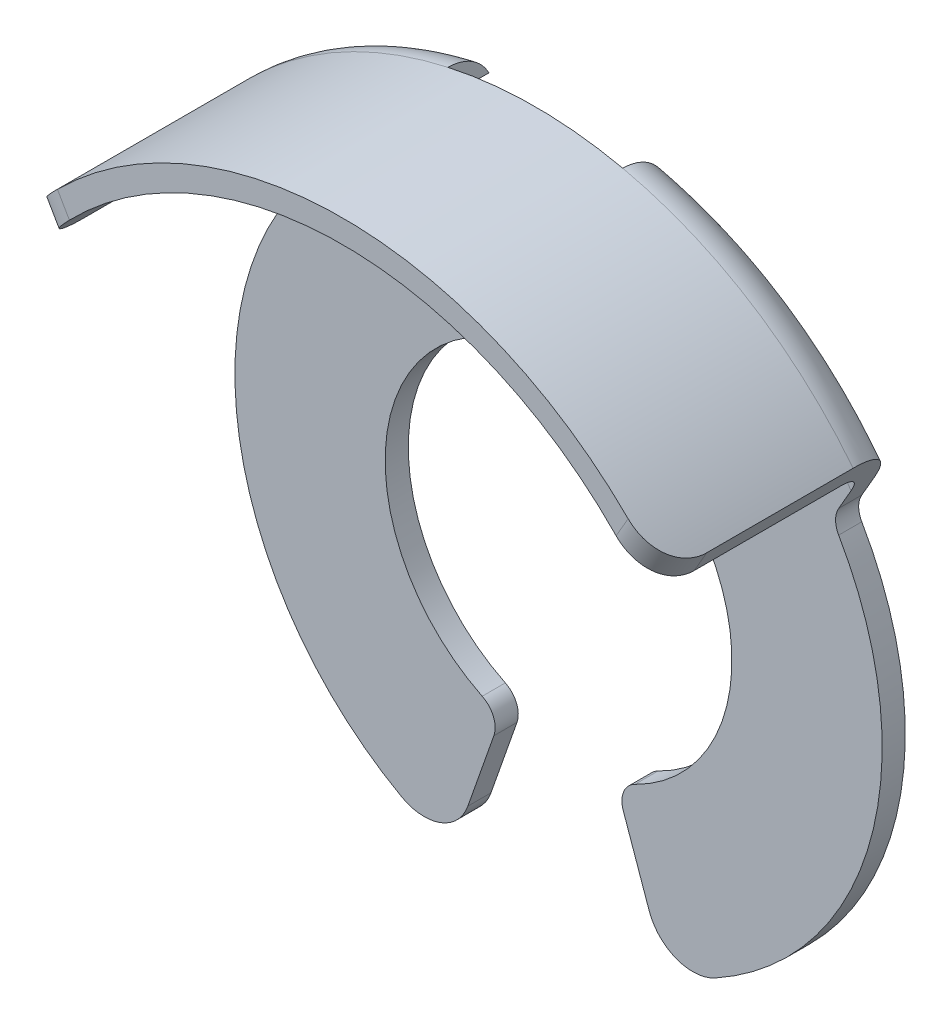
ISO-10303-21;
HEADER;
FILE_DESCRIPTION(('STEP AP214'),'2;1');
FILE_NAME('part.step','',(''),(''),'','','');
FILE_SCHEMA(('AUTOMOTIVE_DESIGN { 1 0 10303 214 1 1 1 1 }'));
ENDSEC;
DATA;
#1=APPLICATION_CONTEXT('core data for automotive mechanical design processes');
#2=APPLICATION_PROTOCOL_DEFINITION('international standard','automotive_design',2000,#1);
#3=PRODUCT_CONTEXT('',#1,'mechanical');
#4=PRODUCT('Part','Part','',(#3));
#5=PRODUCT_RELATED_PRODUCT_CATEGORY('part','',(#4));
#6=PRODUCT_DEFINITION_FORMATION('','',#4);
#7=PRODUCT_DEFINITION_CONTEXT('part definition',#1,'design');
#8=PRODUCT_DEFINITION('design','',#6,#7);
#9=PRODUCT_DEFINITION_SHAPE('','',#8);
#10=(LENGTH_UNIT() NAMED_UNIT(*) SI_UNIT(.MILLI.,.METRE.));
#11=(NAMED_UNIT(*) PLANE_ANGLE_UNIT() SI_UNIT($,.RADIAN.));
#12=(NAMED_UNIT(*) SI_UNIT($,.STERADIAN.) SOLID_ANGLE_UNIT());
#13=UNCERTAINTY_MEASURE_WITH_UNIT(LENGTH_MEASURE(1.E-05),#10,'distance_accuracy_value','');
#14=(GEOMETRIC_REPRESENTATION_CONTEXT(3) GLOBAL_UNCERTAINTY_ASSIGNED_CONTEXT((#13)) GLOBAL_UNIT_ASSIGNED_CONTEXT((#10,
#11,#12)) REPRESENTATION_CONTEXT('',''));
#15=CARTESIAN_POINT('',(0.,0.,0.));
#16=DIRECTION('',(0.,0.,1.));
#17=DIRECTION('',(1.,0.,0.));
#18=AXIS2_PLACEMENT_3D('',#15,#16,#17);
#19=CARTESIAN_POINT('',(0.,0.,-5.6));
#20=DIRECTION('',(0.,0.,1.));
#21=DIRECTION('',(1.,0.,0.));
#22=AXIS2_PLACEMENT_3D('',#19,#20,#21);
#23=CYLINDRICAL_SURFACE('',#22,9.9);
#24=CARTESIAN_POINT('',(0.,0.,-5.));
#25=DIRECTION('',(0.,0.,1.));
#26=DIRECTION('',(1.,0.,0.));
#27=AXIS2_PLACEMENT_3D('',#24,#25,#26);
#28=CIRCLE('',#27,9.9);
#29=CARTESIAN_POINT('',(-7.92245102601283,5.93673055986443,-5.));
#30=VERTEX_POINT('',#29);
#31=CARTESIAN_POINT('',(-2.26782170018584,9.63675177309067,-5.));
#32=VERTEX_POINT('',#31);
#33=EDGE_CURVE('E282',#30,#32,#28,.F.);
#34=ORIENTED_EDGE('',*,*,#33,.T.);
#35=CARTESIAN_POINT('',(0.,0.,-5.));
#36=DIRECTION('',(0.,0.,1.));
#37=DIRECTION('',(1.,0.,0.));
#38=AXIS2_PLACEMENT_3D('',#35,#36,#37);
#39=CIRCLE('',#38,9.9);
#40=CARTESIAN_POINT('',(2.26782170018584,9.63675177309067,-5.));
#41=VERTEX_POINT('',#40);
#42=EDGE_CURVE('E268',#32,#41,#39,.F.);
#43=ORIENTED_EDGE('',*,*,#42,.T.);
#44=CARTESIAN_POINT('',(7.92245102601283,5.93673055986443,-5.));
#45=VERTEX_POINT('',#44);
#46=EDGE_CURVE('E275',#41,#45,#39,.F.);
#47=ORIENTED_EDGE('',*,*,#46,.T.);
#48=DIRECTION('',(0.,0.,1.));
#49=VECTOR('',#48,1.);
#50=CARTESIAN_POINT('',(7.92245102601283,5.93673055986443,-5.6));
#51=LINE('',#50,#49);
#52=CARTESIAN_POINT('',(7.92245102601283,5.93673055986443,-1.2));
#53=VERTEX_POINT('',#52);
#54=EDGE_CURVE('E614',#45,#53,#51,.T.);
#55=ORIENTED_EDGE('',*,*,#54,.T.);
#56=CARTESIAN_POINT('',(7.92245102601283,5.93673055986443,-1.2));
#57=CARTESIAN_POINT('',(7.92245127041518,5.93672863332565,-1.16801673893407));
#58=CARTESIAN_POINT('',(7.92161655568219,5.93784430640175,-1.13604978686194));
#59=CARTESIAN_POINT('',(7.91828924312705,5.94228129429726,-1.07236439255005));
#60=CARTESIAN_POINT('',(7.91579707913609,5.94560203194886,-1.04064588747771));
#61=CARTESIAN_POINT('',(7.90587928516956,5.95879185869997,-0.946422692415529));
#62=CARTESIAN_POINT('',(7.89601210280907,5.97188910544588,-0.884581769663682));
#63=CARTESIAN_POINT('',(7.87008323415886,6.0060171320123,-0.764586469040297));
#64=CARTESIAN_POINT('',(7.85402484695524,6.02704368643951,-0.706430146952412));
#65=CARTESIAN_POINT('',(7.81616207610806,6.07606507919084,-0.595113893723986));
#66=CARTESIAN_POINT('',(7.79435428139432,6.1040640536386,-0.541956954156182));
#67=CARTESIAN_POINT('',(7.74456581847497,6.16712024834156,-0.439830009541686));
#68=CARTESIAN_POINT('',(7.71637570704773,6.20241219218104,-0.391107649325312));
#69=CARTESIAN_POINT('',(7.65500176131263,6.27800265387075,-0.301284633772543));
#70=CARTESIAN_POINT('',(7.62181610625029,6.31830299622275,-0.260186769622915));
#71=CARTESIAN_POINT('',(7.54857564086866,6.40565979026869,-0.183736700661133));
#72=CARTESIAN_POINT('',(7.50819856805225,6.45299363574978,-0.149009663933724));
#73=CARTESIAN_POINT('',(7.42336187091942,6.55040987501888,-0.0899822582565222));
#74=CARTESIAN_POINT('',(7.3789029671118,6.60049178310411,-0.0656800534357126));
#75=CARTESIAN_POINT('',(7.294964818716,6.6930311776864,-0.031407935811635));
#76=CARTESIAN_POINT('',(7.25597611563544,6.73528877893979,-0.0196738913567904));
#77=CARTESIAN_POINT('',(7.17656693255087,6.81984681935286,-0.0039658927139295));
#78=CARTESIAN_POINT('',(7.13614736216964,6.86214721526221,1.29044997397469E-05));
#79=CARTESIAN_POINT('',(7.09531660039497,6.90409171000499,0.));
#80=B_SPLINE_CURVE_WITH_KNOTS('',3,(#56,#57,#58,#59,#60,#61,#62,#63,#64,#65,#66,#67,#68,#69,#70,
#71,#72,#73,#74,#75,#76,#77,#78,#79),.UNSPECIFIED.,.F.,.F.,(4,2,2,2,2,2,2,2,2,2,2,4),(0.,
0.0958875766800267,0.191750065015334,0.382680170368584,0.57350867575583,0.764450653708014,
0.962919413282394,1.16146068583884,1.37427018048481,1.58704218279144,1.76257048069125,
1.9379891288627),.UNSPECIFIED.);
#81=CARTESIAN_POINT('',(7.09531660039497,6.90409171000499,0.));
#82=VERTEX_POINT('',#81);
#83=EDGE_CURVE('E379',#53,#82,#80,.T.);
#84=ORIENTED_EDGE('',*,*,#83,.T.);
#85=CARTESIAN_POINT('',(0.,0.,0.));
#86=DIRECTION('',(0.,0.,1.));
#87=DIRECTION('',(1.,0.,0.));
#88=AXIS2_PLACEMENT_3D('',#85,#86,#87);
#89=CIRCLE('',#88,9.9);
#90=CARTESIAN_POINT('',(-7.09531660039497,6.90409171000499,0.));
#91=VERTEX_POINT('',#90);
#92=EDGE_CURVE('E601',#82,#91,#89,.T.);
#93=ORIENTED_EDGE('',*,*,#92,.T.);
#94=CARTESIAN_POINT('',(-7.09531660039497,6.90409171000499,0.));
#95=CARTESIAN_POINT('',(-7.14661710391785,6.85141432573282,3.83472972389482E-05));
#96=CARTESIAN_POINT('',(-7.19725615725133,6.79815530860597,-0.00625582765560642));
#97=CARTESIAN_POINT('',(-7.29594652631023,6.69210325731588,-0.0309570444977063));
#98=CARTESIAN_POINT('',(-7.343999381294,6.63930996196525,-0.0493567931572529));
#99=CARTESIAN_POINT('',(-7.43631639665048,6.53575229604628,-0.0977178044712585));
#100=CARTESIAN_POINT('',(-7.48058062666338,6.48498788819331,-0.127678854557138));
#101=CARTESIAN_POINT('',(-7.56430099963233,6.38713458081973,-0.198401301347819));
#102=CARTESIAN_POINT('',(-7.60375699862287,6.3400457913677,-0.23916302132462));
#103=CARTESIAN_POINT('',(-7.6769612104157,6.25120716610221,-0.330612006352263));
#104=CARTESIAN_POINT('',(-7.71070258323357,6.20946374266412,-0.381311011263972));
#105=CARTESIAN_POINT('',(-7.77152793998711,6.13316717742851,-0.491414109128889));
#106=CARTESIAN_POINT('',(-7.79861239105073,6.09861353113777,-0.550817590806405));
#107=CARTESIAN_POINT('',(-7.8441399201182,6.039932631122,-0.673634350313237));
#108=CARTESIAN_POINT('',(-7.86293924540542,6.01537997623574,-0.736712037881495));
#109=CARTESIAN_POINT('',(-7.89309233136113,5.9757612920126,-0.867412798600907));
#110=CARTESIAN_POINT('',(-7.90445919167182,5.96067857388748,-0.935027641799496));
#111=CARTESIAN_POINT('',(-7.91541337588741,5.94611302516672,-1.03612600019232));
#112=CARTESIAN_POINT('',(-7.91805129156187,5.94259842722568,-1.06876387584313));
#113=CARTESIAN_POINT('',(-7.92156895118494,5.93790789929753,-1.13426147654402));
#114=CARTESIAN_POINT('',(-7.92245081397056,5.93672915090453,-1.16712088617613));
#115=CARTESIAN_POINT('',(-7.92245102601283,5.93673055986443,-1.2));
#116=B_SPLINE_CURVE_WITH_KNOTS('',3,(#94,#95,#96,#97,#98,#99,#100,#101,#102,#103,#104,#105,#106,
#107,#108,#109,#110,#111,#112,#113,#114,#115),.UNSPECIFIED.,.F.,.F.,(4,2,2,2,2,2,2,2,2,2,4),(0.,
0.220254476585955,0.440376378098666,0.660494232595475,0.880618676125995,1.10100475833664,
1.32137537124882,1.53102684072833,1.74030779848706,1.83899278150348,1.93755861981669),.UNSPECIFIED.);
#117=CARTESIAN_POINT('',(-7.92245102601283,5.93673055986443,-1.2));
#118=VERTEX_POINT('',#117);
#119=EDGE_CURVE('E370',#91,#118,#116,.T.);
#120=ORIENTED_EDGE('',*,*,#119,.T.);
#121=DIRECTION('',(0.,0.,1.));
#122=VECTOR('',#121,1.);
#123=CARTESIAN_POINT('',(-7.92245102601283,5.93673055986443,-5.6));
#124=LINE('',#123,#122);
#125=EDGE_CURVE('E621',#118,#30,#124,.F.);
#126=ORIENTED_EDGE('',*,*,#125,.T.);
#127=EDGE_LOOP('',(#34,#43,#47,#55,#84,#93,#120,#126));
#128=FACE_BOUND('',#127,.T.);
#129=ADVANCED_FACE('F39',(#128),#23,.F.);
#130=CARTESIAN_POINT('',(-1.72450293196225,8.52737296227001,-6.2));
#131=DIRECTION('',(0.,0.,1.));
#132=DIRECTION('',(1.,0.,0.));
#133=AXIS2_PLACEMENT_3D('',#130,#131,#132);
#134=CYLINDRICAL_SURFACE('',#133,1.2);
#135=DIRECTION('',(0.,0.,1.));
#136=VECTOR('',#135,1.);
#137=CARTESIAN_POINT('',(-2.26782170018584,9.59732843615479,-6.2));
#138=LINE('',#137,#136);
#139=CARTESIAN_POINT('',(-2.26782170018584,9.59732843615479,-5.21112262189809));
#140=VERTEX_POINT('',#139);
#141=CARTESIAN_POINT('',(-2.26782170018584,9.59732843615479,-6.06045875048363));
#142=VERTEX_POINT('',#141);
#143=EDGE_CURVE('E792',#140,#142,#138,.F.);
#144=ORIENTED_EDGE('',*,*,#143,.F.);
#145=CARTESIAN_POINT('',(-2.88252105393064,8.84200612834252,-5.6));
#146=CARTESIAN_POINT('',(-2.8757470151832,8.86695765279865,-5.59999778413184));
#147=CARTESIAN_POINT('',(-2.86816563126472,8.89165400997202,-5.59883198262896));
#148=CARTESIAN_POINT('',(-2.85151274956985,8.94029609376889,-5.59444958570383));
#149=CARTESIAN_POINT('',(-2.84244453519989,8.96424333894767,-5.59123746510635));
#150=CARTESIAN_POINT('',(-2.81337727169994,9.0342073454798,-5.57903305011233));
#151=CARTESIAN_POINT('',(-2.79134998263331,9.07894476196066,-5.56745924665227));
#152=CARTESIAN_POINT('',(-2.73770561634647,9.17309114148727,-5.53622429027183));
#153=CARTESIAN_POINT('',(-2.70504568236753,9.22148967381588,-5.51537100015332));
#154=CARTESIAN_POINT('',(-2.63446135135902,9.31177086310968,-5.46844747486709));
#155=CARTESIAN_POINT('',(-2.59650982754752,9.3536174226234,-5.44235003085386));
#156=CARTESIAN_POINT('',(-2.50281400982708,9.44377465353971,-5.37706573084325));
#157=CARTESIAN_POINT('',(-2.44543939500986,9.48935874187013,-5.33646401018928));
#158=CARTESIAN_POINT('',(-2.32549759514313,9.56850927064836,-5.25170676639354));
#159=CARTESIAN_POINT('',(-2.26293500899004,9.60208621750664,-5.20755439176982));
#160=CARTESIAN_POINT('',(-2.16124732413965,9.64580923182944,-5.13651310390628));
#161=CARTESIAN_POINT('',(-2.12335154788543,9.65986718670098,-5.11018723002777));
#162=CARTESIAN_POINT('',(-2.04656423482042,9.68404646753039,-5.05726610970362));
#163=CARTESIAN_POINT('',(-2.00767416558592,9.69417327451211,-5.03067129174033));
#164=CARTESIAN_POINT('',(-1.96638957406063,9.70274314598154,-5.00272219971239));
#165=CARTESIAN_POINT('',(-1.96437798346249,9.70315532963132,-5.00136108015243));
#166=CARTESIAN_POINT('',(-1.96236540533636,9.70356233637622,-5.));
#167=B_SPLINE_CURVE_WITH_KNOTS('',3,(#145,#146,#147,#148,#149,#150,#151,#152,#153,#154,#155,
#156,#157,#158,#159,#160,#161,#162,#163,#164,#165,#166),.UNSPECIFIED.,.F.,.F.,(4,2,2,2,2,2,2,2,
2,2,4),(0.,0.077469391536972,0.15476995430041,0.307539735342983,0.492590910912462,
0.678628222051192,0.928648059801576,1.17844858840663,1.32301607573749,1.46738126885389,
1.47477186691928),.UNSPECIFIED.);
#168=CARTESIAN_POINT('',(-2.88252105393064,8.84200612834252,-5.6));
#169=VERTEX_POINT('',#168);
#170=EDGE_CURVE('E462',#140,#169,#167,.F.);
#171=ORIENTED_EDGE('',*,*,#170,.T.);
#172=CARTESIAN_POINT('',(-1.72450293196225,8.52737296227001,-5.6));
#173=DIRECTION('',(0.,0.,1.));
#174=DIRECTION('',(-1.,0.,0.));
#175=AXIS2_PLACEMENT_3D('',#172,#173,#174);
#176=CIRCLE('',#175,1.2);
#177=CARTESIAN_POINT('',(-2.85664147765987,8.12955100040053,-5.6));
#178=VERTEX_POINT('',#177);
#179=EDGE_CURVE('E547',#169,#178,#176,.T.);
#180=ORIENTED_EDGE('',*,*,#179,.T.);
#181=DIRECTION('',(0.,0.,1.));
#182=VECTOR('',#181,1.);
#183=CARTESIAN_POINT('',(-2.85664147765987,8.12955100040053,-6.2));
#184=LINE('',#183,#182);
#185=CARTESIAN_POINT('',(-2.85664147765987,8.12955100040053,-6.2));
#186=VERTEX_POINT('',#185);
#187=EDGE_CURVE('E552',#186,#178,#184,.T.);
#188=ORIENTED_EDGE('',*,*,#187,.F.);
#189=CARTESIAN_POINT('',(-1.72450293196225,8.52737296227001,-6.2));
#190=DIRECTION('',(0.,0.,1.));
#191=DIRECTION('',(-1.,0.,0.));
#192=AXIS2_PLACEMENT_3D('',#189,#190,#191);
#193=CIRCLE('',#192,1.2);
#194=CARTESIAN_POINT('',(-2.88252105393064,8.84200612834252,-6.2));
#195=VERTEX_POINT('',#194);
#196=EDGE_CURVE('E521',#195,#186,#193,.T.);
#197=ORIENTED_EDGE('',*,*,#196,.F.);
#198=CARTESIAN_POINT('',(-2.88252105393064,8.84200612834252,-6.2));
#199=CARTESIAN_POINT('',(-2.87406583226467,8.87313652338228,-6.20000036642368));
#200=CARTESIAN_POINT('',(-2.86435742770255,8.90389515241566,-6.19909042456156));
#201=CARTESIAN_POINT('',(-2.8425439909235,8.96442785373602,-6.19573272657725));
#202=CARTESIAN_POINT('',(-2.83044163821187,8.99420298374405,-6.19328668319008));
#203=CARTESIAN_POINT('',(-2.79083499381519,9.08144370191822,-6.18410118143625));
#204=CARTESIAN_POINT('',(-2.75992685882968,9.13720398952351,-6.1755074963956));
#205=CARTESIAN_POINT('',(-2.69016026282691,9.24256034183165,-6.15562931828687));
#206=CARTESIAN_POINT('',(-2.65133243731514,9.29217900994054,-6.1443551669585));
#207=CARTESIAN_POINT('',(-2.56641103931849,9.38477752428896,-6.12116401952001));
#208=CARTESIAN_POINT('',(-2.52030224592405,9.42774308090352,-6.10924571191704));
#209=CARTESIAN_POINT('',(-2.41747743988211,9.50944327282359,-6.08584502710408));
#210=CARTESIAN_POINT('',(-2.36019102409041,9.54749971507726,-6.07448755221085));
#211=CARTESIAN_POINT('',(-2.23951261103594,9.61340260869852,-6.05586223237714));
#212=CARTESIAN_POINT('',(-2.17613822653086,9.64127745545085,-6.04858298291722));
#213=CARTESIAN_POINT('',(-2.08649831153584,9.67175929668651,-6.04254510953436));
#214=CARTESIAN_POINT('',(-2.06197063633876,9.67922999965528,-6.04130706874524));
#215=CARTESIAN_POINT('',(-2.01247567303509,9.6925882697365,-6.03964919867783));
#216=CARTESIAN_POINT('',(-1.98750863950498,9.69847672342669,-6.03922891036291));
#217=CARTESIAN_POINT('',(-1.96236540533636,9.70356233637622,-6.03923048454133));
#218=B_SPLINE_CURVE_WITH_KNOTS('',3,(#198,#199,#200,#201,#202,#203,#204,#205,#206,#207,#208,
#209,#210,#211,#212,#213,#214,#215,#216,#217),.UNSPECIFIED.,.F.,.F.,(4,2,2,2,2,2,2,2,2,4),(0.,
0.0966843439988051,0.193261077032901,0.38525146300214,0.576512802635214,0.768179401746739,
0.976272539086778,1.18378081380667,1.26073805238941,1.3376520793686),.UNSPECIFIED.);
#219=EDGE_CURVE('E380',#195,#142,#218,.T.);
#220=ORIENTED_EDGE('',*,*,#219,.T.);
#221=EDGE_LOOP('',(#144,#171,#180,#188,#197,#220));
#222=FACE_BOUND('',#221,.T.);
#223=ADVANCED_FACE('F395',(#222),#134,.F.);
#224=CARTESIAN_POINT('',(1.72450293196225,8.52737296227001,-6.2));
#225=DIRECTION('',(0.,0.,1.));
#226=DIRECTION('',(1.,0.,0.));
#227=AXIS2_PLACEMENT_3D('',#224,#225,#226);
#228=CYLINDRICAL_SURFACE('',#227,1.2);
#229=DIRECTION('',(0.,0.,1.));
#230=VECTOR('',#229,1.);
#231=CARTESIAN_POINT('',(2.26782170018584,9.59732843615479,-6.2));
#232=LINE('',#231,#230);
#233=CARTESIAN_POINT('',(2.26782170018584,9.59732843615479,-6.06045875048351));
#234=VERTEX_POINT('',#233);
#235=CARTESIAN_POINT('',(2.26782170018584,9.59732843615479,-5.21112262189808));
#236=VERTEX_POINT('',#235);
#237=EDGE_CURVE('E260',#234,#236,#232,.T.);
#238=ORIENTED_EDGE('',*,*,#237,.F.);
#239=CARTESIAN_POINT('',(1.96236540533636,9.70356233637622,-6.03923048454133));
#240=CARTESIAN_POINT('',(1.99404870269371,9.69715712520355,-6.03922131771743));
#241=CARTESIAN_POINT('',(2.02545391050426,9.68947057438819,-6.03989418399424));
#242=CARTESIAN_POINT('',(2.08747456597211,9.67161590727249,-6.0425201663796));
#243=CARTESIAN_POINT('',(2.11809051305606,9.66144940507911,-6.04447245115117));
#244=CARTESIAN_POINT('',(2.20807595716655,9.62748362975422,-6.05209124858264));
#245=CARTESIAN_POINT('',(2.26599830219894,9.60013306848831,-6.05952184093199));
#246=CARTESIAN_POINT('',(2.37621980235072,9.53697798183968,-6.07760125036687));
#247=CARTESIAN_POINT('',(2.42853096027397,9.50119204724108,-6.08824300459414));
#248=CARTESIAN_POINT('',(2.52684044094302,9.42193897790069,-6.11086867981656));
#249=CARTESIAN_POINT('',(2.57282326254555,9.37845355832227,-6.12285577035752));
#250=CARTESIAN_POINT('',(2.66054644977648,9.28130548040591,-6.14694493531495));
#251=CARTESIAN_POINT('',(2.7017400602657,9.22713444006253,-6.15899271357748));
#252=CARTESIAN_POINT('',(2.77452847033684,9.11221501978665,-6.17957894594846));
#253=CARTESIAN_POINT('',(2.80615434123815,9.05148881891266,-6.18812879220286));
#254=CARTESIAN_POINT('',(2.84232335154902,8.96457356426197,-6.19561749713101));
#255=CARTESIAN_POINT('',(2.85145868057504,8.94045559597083,-6.19722509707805));
#256=CARTESIAN_POINT('',(2.86817010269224,8.89163938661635,-6.19941624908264));
#257=CARTESIAN_POINT('',(2.87574610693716,8.86694111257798,-6.19999974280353));
#258=CARTESIAN_POINT('',(2.88252105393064,8.84200612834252,-6.2));
#259=B_SPLINE_CURVE_WITH_KNOTS('',3,(#239,#240,#241,#242,#243,#244,#245,#246,#247,#248,#249,
#250,#251,#252,#253,#254,#255,#256,#257,#258),.UNSPECIFIED.,.F.,.F.,(4,2,2,2,2,2,2,2,2,4),(0.,
0.0969041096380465,0.193745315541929,0.386174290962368,0.578183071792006,0.770654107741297,
0.977034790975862,1.18273787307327,1.26019732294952,1.33766118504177),.UNSPECIFIED.);
#260=CARTESIAN_POINT('',(2.88252105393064,8.84200612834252,-6.2));
#261=VERTEX_POINT('',#260);
#262=EDGE_CURVE('E728',#234,#261,#259,.T.);
#263=ORIENTED_EDGE('',*,*,#262,.T.);
#264=CARTESIAN_POINT('',(1.72450293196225,8.52737296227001,-6.2));
#265=DIRECTION('',(0.,0.,1.));
#266=DIRECTION('',(-1.,0.,0.));
#267=AXIS2_PLACEMENT_3D('',#264,#265,#266);
#268=CIRCLE('',#267,1.2);
#269=CARTESIAN_POINT('',(2.85664147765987,8.12955100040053,-6.2));
#270=VERTEX_POINT('',#269);
#271=EDGE_CURVE('E517',#270,#261,#268,.T.);
#272=ORIENTED_EDGE('',*,*,#271,.F.);
#273=DIRECTION('',(0.,0.,1.));
#274=VECTOR('',#273,1.);
#275=CARTESIAN_POINT('',(2.85664147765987,8.12955100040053,-6.2));
#276=LINE('',#275,#274);
#277=CARTESIAN_POINT('',(2.85664147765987,8.12955100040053,-5.6));
#278=VERTEX_POINT('',#277);
#279=EDGE_CURVE('E557',#270,#278,#276,.T.);
#280=ORIENTED_EDGE('',*,*,#279,.T.);
#281=CARTESIAN_POINT('',(1.72450293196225,8.52737296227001,-5.6));
#282=DIRECTION('',(0.,0.,1.));
#283=DIRECTION('',(-1.,0.,0.));
#284=AXIS2_PLACEMENT_3D('',#281,#282,#283);
#285=CIRCLE('',#284,1.2);
#286=CARTESIAN_POINT('',(2.88252105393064,8.84200612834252,-5.6));
#287=VERTEX_POINT('',#286);
#288=EDGE_CURVE('E543',#278,#287,#285,.T.);
#289=ORIENTED_EDGE('',*,*,#288,.T.);
#290=CARTESIAN_POINT('',(2.88252105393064,8.84200612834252,-5.6));
#291=CARTESIAN_POINT('',(2.8757470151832,8.86695765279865,-5.59999778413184));
#292=CARTESIAN_POINT('',(2.86816563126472,8.89165400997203,-5.59883198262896));
#293=CARTESIAN_POINT('',(2.85151274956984,8.94029609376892,-5.59444958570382));
#294=CARTESIAN_POINT('',(2.84244453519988,8.96424333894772,-5.59123746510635));
#295=CARTESIAN_POINT('',(2.81337727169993,9.03420734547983,-5.57903305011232));
#296=CARTESIAN_POINT('',(2.7913499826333,9.07894476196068,-5.56745924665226));
#297=CARTESIAN_POINT('',(2.73770561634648,9.17309114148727,-5.53622429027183));
#298=CARTESIAN_POINT('',(2.70504568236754,9.22148967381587,-5.51537100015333));
#299=CARTESIAN_POINT('',(2.63446135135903,9.31177086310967,-5.46844747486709));
#300=CARTESIAN_POINT('',(2.59650982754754,9.35361742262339,-5.44235003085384));
#301=CARTESIAN_POINT('',(2.50281400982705,9.44377465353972,-5.37706573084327));
#302=CARTESIAN_POINT('',(2.44543939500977,9.48935874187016,-5.33646401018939));
#303=CARTESIAN_POINT('',(2.3254975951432,9.56850927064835,-5.2517067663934));
#304=CARTESIAN_POINT('',(2.26293500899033,9.60208621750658,-5.20755439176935));
#305=CARTESIAN_POINT('',(2.16124732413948,9.64580923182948,-5.13651310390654));
#306=CARTESIAN_POINT('',(2.12335154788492,9.65986718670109,-5.11018723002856));
#307=CARTESIAN_POINT('',(2.04656423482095,9.68404646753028,-5.05726610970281));
#308=CARTESIAN_POINT('',(2.00767416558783,9.69417327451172,-5.0306712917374));
#309=CARTESIAN_POINT('',(1.96638957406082,9.7027431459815,-5.00272219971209));
#310=CARTESIAN_POINT('',(1.96437798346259,9.7031553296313,-5.00136108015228));
#311=CARTESIAN_POINT('',(1.96236540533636,9.70356233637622,-5.));
#312=B_SPLINE_CURVE_WITH_KNOTS('',3,(#290,#291,#292,#293,#294,#295,#296,#297,#298,#299,#300,
#301,#302,#303,#304,#305,#306,#307,#308,#309,#310,#311),.UNSPECIFIED.,.F.,.F.,(4,2,2,2,2,2,2,2,
2,2,4),(0.,0.0774693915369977,0.154769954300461,0.307539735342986,0.492590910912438,
0.678628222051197,0.928648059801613,1.17844858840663,1.32301607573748,1.46738126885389,
1.47477186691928),.UNSPECIFIED.);
#313=EDGE_CURVE('E303',#287,#236,#312,.T.);
#314=ORIENTED_EDGE('',*,*,#313,.T.);
#315=EDGE_LOOP('',(#238,#263,#272,#280,#289,#314));
#316=FACE_BOUND('',#315,.T.);
#317=ADVANCED_FACE('F317',(#316),#228,.F.);
#318=CARTESIAN_POINT('',(0.,0.,-5.));
#319=DIRECTION('',(0.,0.,1.));
#320=DIRECTION('',(1.,0.,0.));
#321=AXIS2_PLACEMENT_3D('',#318,#319,#320);
#322=TOROIDAL_SURFACE('',#321,9.3,1.2);
#323=ORIENTED_EDGE('',*,*,#262,.F.);
#324=CARTESIAN_POINT('',(2.26782170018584,7.95095885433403,-5.61244842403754));
#325=CARTESIAN_POINT('',(2.26782170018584,7.98718643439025,-5.67114225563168));
#326=CARTESIAN_POINT('',(2.26782170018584,8.0285456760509,-5.72674125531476));
#327=CARTESIAN_POINT('',(2.26782170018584,8.1201211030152,-5.83018783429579));
#328=CARTESIAN_POINT('',(2.26782170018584,8.17035198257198,-5.87802229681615));
#329=CARTESIAN_POINT('',(2.26782170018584,8.27796002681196,-5.9645855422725));
#330=CARTESIAN_POINT('',(2.26782170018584,8.33532284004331,-6.00333217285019));
#331=CARTESIAN_POINT('',(2.26782170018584,8.45558565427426,-6.07090798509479));
#332=CARTESIAN_POINT('',(2.26782170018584,8.51848412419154,-6.09973989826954));
#333=CARTESIAN_POINT('',(2.26782170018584,8.64974176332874,-6.14743178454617));
#334=CARTESIAN_POINT('',(2.26782170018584,8.71819814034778,-6.16602443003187));
#335=CARTESIAN_POINT('',(2.26782170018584,8.85724866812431,-6.19165158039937));
#336=CARTESIAN_POINT('',(2.26782170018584,8.92784316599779,-6.19868419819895));
#337=CARTESIAN_POINT('',(2.26782170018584,9.07031601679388,-6.20099697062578));
#338=CARTESIAN_POINT('',(2.26782170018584,9.14219743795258,-6.19609499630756));
#339=CARTESIAN_POINT('',(2.26782170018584,9.28410385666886,-6.174218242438));
#340=CARTESIAN_POINT('',(2.26782170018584,9.3541288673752,-6.15724354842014));
#341=CARTESIAN_POINT('',(2.26782170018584,9.4898360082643,-6.11173605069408));
#342=CARTESIAN_POINT('',(2.26782170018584,9.55554255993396,-6.08327619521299));
#343=CARTESIAN_POINT('',(2.26782170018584,9.6810955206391,-6.01549308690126));
#344=CARTESIAN_POINT('',(2.26782170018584,9.74094256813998,-5.97617101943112));
#345=CARTESIAN_POINT('',(2.26782170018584,9.85167190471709,-5.88866446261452));
#346=CARTESIAN_POINT('',(2.26782170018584,9.9027199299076,-5.84068978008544));
#347=CARTESIAN_POINT('',(2.26782170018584,9.99576994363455,-5.73664677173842));
#348=CARTESIAN_POINT('',(2.26782170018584,10.037773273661,-5.68057964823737));
#349=CARTESIAN_POINT('',(2.26782170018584,10.1103810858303,-5.56352671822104));
#350=CARTESIAN_POINT('',(2.26782170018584,10.1412552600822,-5.50270816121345));
#351=CARTESIAN_POINT('',(2.26782170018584,10.1921050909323,-5.37667388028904));
#352=CARTESIAN_POINT('',(2.26782170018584,10.2120821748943,-5.31145873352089));
#353=CARTESIAN_POINT('',(2.26782170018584,10.2401789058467,-5.17994583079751));
#354=CARTESIAN_POINT('',(2.26782170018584,10.2485367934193,-5.11369889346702));
#355=CARTESIAN_POINT('',(2.26782170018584,10.2538986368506,-4.98074902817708));
#356=CARTESIAN_POINT('',(2.26782170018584,10.2509033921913,-4.91404613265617));
#357=CARTESIAN_POINT('',(2.26782170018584,10.2337370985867,-4.78271816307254));
#358=CARTESIAN_POINT('',(2.26782170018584,10.2196683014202,-4.71807968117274));
#359=CARTESIAN_POINT('',(2.26782170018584,10.180927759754,-4.59206582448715));
#360=CARTESIAN_POINT('',(2.26782170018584,10.1562559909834,-4.5306904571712));
#361=CARTESIAN_POINT('',(2.26782170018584,10.0969345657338,-4.41260590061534));
#362=CARTESIAN_POINT('',(2.26782170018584,10.062237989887,-4.35592030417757));
#363=CARTESIAN_POINT('',(2.26782170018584,9.98397099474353,-4.24905276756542));
#364=CARTESIAN_POINT('',(2.26782170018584,9.94039996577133,-4.19887127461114));
#365=CARTESIAN_POINT('',(2.26782170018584,9.84485007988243,-4.10549429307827));
#366=CARTESIAN_POINT('',(2.26782170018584,9.79274011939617,-4.06243302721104));
#367=CARTESIAN_POINT('',(2.26782170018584,9.68217778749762,-3.9854215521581));
#368=CARTESIAN_POINT('',(2.26782170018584,9.62372468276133,-3.95147239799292));
#369=CARTESIAN_POINT('',(2.26782170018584,9.50060023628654,-3.89275351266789));
#370=CARTESIAN_POINT('',(2.26782170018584,9.43581108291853,-3.86823084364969));
#371=CARTESIAN_POINT('',(2.26782170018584,9.30309393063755,-3.83011927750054));
#372=CARTESIAN_POINT('',(2.26782170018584,9.23516551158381,-3.81653184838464));
#373=CARTESIAN_POINT('',(2.26782170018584,9.09632333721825,-3.80036201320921));
#374=CARTESIAN_POINT('',(2.26782170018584,9.02537720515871,-3.79805704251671));
#375=CARTESIAN_POINT('',(2.26782170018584,8.88407716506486,-3.80520744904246));
#376=CARTESIAN_POINT('',(2.26782170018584,8.81372332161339,-3.81466409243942));
#377=CARTESIAN_POINT('',(2.26782170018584,8.67455089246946,-3.84529883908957));
#378=CARTESIAN_POINT('',(2.26782170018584,8.60576877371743,-3.86664303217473));
#379=CARTESIAN_POINT('',(2.26782170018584,8.47278382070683,-3.92063046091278));
#380=CARTESIAN_POINT('',(2.26782170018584,8.40858108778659,-3.95327394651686));
#381=CARTESIAN_POINT('',(2.26782170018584,8.28699543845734,-4.02884886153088));
#382=CARTESIAN_POINT('',(2.26782170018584,8.22957911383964,-4.07172646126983));
#383=CARTESIAN_POINT('',(2.26782170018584,8.12300912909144,-4.16675799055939));
#384=CARTESIAN_POINT('',(2.26782170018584,8.07385436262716,-4.21891067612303));
#385=CARTESIAN_POINT('',(2.26782170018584,7.98668867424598,-4.32954488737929));
#386=CARTESIAN_POINT('',(2.26782170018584,7.94841230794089,-4.3878170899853));
#387=CARTESIAN_POINT('',(2.26782170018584,7.88263684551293,-4.51015454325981));
#388=CARTESIAN_POINT('',(2.26782170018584,7.85513461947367,-4.57421810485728));
#389=CARTESIAN_POINT('',(2.26782170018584,7.81276442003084,-4.70371273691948));
#390=CARTESIAN_POINT('',(2.26782170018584,7.79745800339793,-4.76900048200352));
#391=CARTESIAN_POINT('',(2.26782170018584,7.77835304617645,-4.90125524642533));
#392=CARTESIAN_POINT('',(2.26782170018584,7.77455546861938,-4.96822240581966));
#393=CARTESIAN_POINT('',(2.26782170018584,7.77855983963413,-5.10005640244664));
#394=CARTESIAN_POINT('',(2.26782170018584,7.78606385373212,-5.16493270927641));
#395=CARTESIAN_POINT('',(2.26782170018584,7.81185206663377,-5.29244283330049));
#396=CARTESIAN_POINT('',(2.26782170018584,7.83012223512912,-5.35507945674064));
#397=CARTESIAN_POINT('',(2.26782170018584,7.86658053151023,-5.44994091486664));
#398=CARTESIAN_POINT('',(2.26782170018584,7.88133666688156,-5.48352644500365));
#399=CARTESIAN_POINT('',(2.26782170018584,7.91389834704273,-5.54918217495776));
#400=CARTESIAN_POINT('',(2.26782170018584,7.93170376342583,-5.58125243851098));
#401=CARTESIAN_POINT('',(2.26782170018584,7.95095885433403,-5.61244842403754));
#402=B_SPLINE_CURVE_WITH_KNOTS('',3,(#324,#325,#326,#327,#328,#329,#330,#331,#332,#333,#334,
#335,#336,#337,#338,#339,#340,#341,#342,#343,#344,#345,#346,#347,#348,#349,#350,#351,#352,#353,
#354,#355,#356,#357,#358,#359,#360,#361,#362,#363,#364,#365,#366,#367,#368,#369,#370,#371,#372,
#373,#374,#375,#376,#377,#378,#379,#380,#381,#382,#383,#384,#385,#386,#387,#388,#389,#390,#391,
#392,#393,#394,#395,#396,#397,#398,#399,#400,#401),.UNSPECIFIED.,.T.,.F.,(4,2,2,2,2,2,2,2,2,2,2,
2,2,2,2,2,2,2,2,2,2,2,2,2,2,2,2,2,2,2,2,2,2,2,2,2,2,2,4),(0.,0.206782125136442,
0.413910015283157,0.620627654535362,0.827288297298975,1.03911562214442,1.25097752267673,
1.46609277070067,1.68120649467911,1.89497489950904,2.10871998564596,2.31784752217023,
2.52694401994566,2.73056502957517,2.93415936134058,3.13351433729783,3.33285527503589,
3.53037681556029,3.72789880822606,3.92636067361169,4.12483617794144,4.32670763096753,
4.52860244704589,4.7354769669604,4.94237925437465,5.1543445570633,5.36633268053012,
5.58135976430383,5.79639160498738,6.01031641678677,6.22421255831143,6.43232356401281,
6.64037406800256,6.84055701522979,7.04075671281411,7.23577028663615,7.43053028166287,
7.54044036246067,7.65034581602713),.UNSPECIFIED.);
#403=CARTESIAN_POINT('',(2.26782170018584,10.252169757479,-5.));
#404=VERTEX_POINT('',#403);
#405=EDGE_CURVE('E489',#234,#404,#402,.T.);
#406=ORIENTED_EDGE('',*,*,#405,.T.);
#407=CARTESIAN_POINT('',(0.,0.,-5.));
#408=DIRECTION('',(0.,0.,1.));
#409=DIRECTION('',(1.,0.,0.));
#410=AXIS2_PLACEMENT_3D('',#407,#408,#409);
#411=CIRCLE('',#410,10.5);
#412=CARTESIAN_POINT('',(8.24704443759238,6.49894284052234,-5.));
#413=VERTEX_POINT('',#412);
#414=EDGE_CURVE('E427',#413,#404,#411,.T.);
#415=ORIENTED_EDGE('',*,*,#414,.F.);
#416=CARTESIAN_POINT('',(7.59422180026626,5.36822086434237,-6.2));
#417=CARTESIAN_POINT('',(7.63366848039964,5.43654451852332,-6.20004028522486));
#418=CARTESIAN_POINT('',(7.67314199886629,5.50491465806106,-6.19358304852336));
#419=CARTESIAN_POINT('',(7.75111969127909,5.63997598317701,-6.16769886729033));
#420=CARTESIAN_POINT('',(7.78962087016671,5.70666198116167,-6.14823596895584));
#421=CARTESIAN_POINT('',(7.8644745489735,5.83631235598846,-6.09631393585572));
#422=CARTESIAN_POINT('',(7.90082256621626,5.89926896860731,-6.06382871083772));
#423=CARTESIAN_POINT('',(7.96998922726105,6.01906913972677,-5.98637967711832));
#424=CARTESIAN_POINT('',(8.0028125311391,6.07592076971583,-5.94143263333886));
#425=CARTESIAN_POINT('',(8.06183061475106,6.17814308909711,-5.84310275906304));
#426=CARTESIAN_POINT('',(8.08830655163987,6.22400075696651,-5.79039623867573));
#427=CARTESIAN_POINT('',(8.13598217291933,6.30657735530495,-5.67611493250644));
#428=CARTESIAN_POINT('',(8.15718203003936,6.34329658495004,-5.61454043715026));
#429=CARTESIAN_POINT('',(8.19184779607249,6.40333945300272,-5.48980483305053));
#430=CARTESIAN_POINT('',(8.20580573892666,6.42751531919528,-5.42718894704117));
#431=CARTESIAN_POINT('',(8.22785988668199,6.46571422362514,-5.29800862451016));
#432=CARTESIAN_POINT('',(8.23596657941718,6.47975542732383,-5.23145148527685));
#433=CARTESIAN_POINT('',(8.24299815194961,6.49193446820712,-5.13688932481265));
#434=CARTESIAN_POINT('',(8.24451542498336,6.49456246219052,-5.10957793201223));
#435=CARTESIAN_POINT('',(8.24653745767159,6.4980647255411,-5.05484910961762));
#436=CARTESIAN_POINT('',(8.24704381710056,6.49894176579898,-5.02743191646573));
#437=CARTESIAN_POINT('',(8.24704443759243,6.49894284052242,-5.00000000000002));
#438=B_SPLINE_CURVE_WITH_KNOTS('',3,(#416,#417,#418,#419,#420,#421,#422,#423,#424,#425,#426,
#427,#428,#429,#430,#431,#432,#433,#434,#435,#436,#437),.UNSPECIFIED.,.F.,.F.,(4,2,2,2,2,2,2,2,
2,2,4),(0.,0.236502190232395,0.473660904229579,0.71129715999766,0.9486152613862,
1.17155120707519,1.39447985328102,1.59910749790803,1.80336744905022,1.88574574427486,
1.96799357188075),.UNSPECIFIED.);
#439=CARTESIAN_POINT('',(7.59422180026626,5.36822086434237,-6.2));
#440=VERTEX_POINT('',#439);
#441=EDGE_CURVE('E724',#440,#413,#438,.T.);
#442=ORIENTED_EDGE('',*,*,#441,.F.);
#443=CARTESIAN_POINT('',(0.,0.,-6.2));
#444=DIRECTION('',(0.,0.,1.));
#445=DIRECTION('',(1.,0.,0.));
#446=AXIS2_PLACEMENT_3D('',#443,#444,#445);
#447=CIRCLE('',#446,9.3);
#448=EDGE_CURVE('E444',#261,#440,#447,.F.);
#449=ORIENTED_EDGE('',*,*,#448,.F.);
#450=EDGE_LOOP('',(#323,#406,#415,#442,#449));
#451=FACE_BOUND('',#450,.T.);
#452=ADVANCED_FACE('F416',(#451),#322,.T.);
#453=CARTESIAN_POINT('',(-2.26782170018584,10.252169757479,-5.));
#454=VERTEX_POINT('',#453);
#455=CARTESIAN_POINT('',(-8.24704443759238,6.49894284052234,-5.));
#456=VERTEX_POINT('',#455);
#457=EDGE_CURVE('E426',#454,#456,#411,.T.);
#458=ORIENTED_EDGE('',*,*,#457,.F.);
#459=CARTESIAN_POINT('',(-2.26782170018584,7.95095885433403,-5.61244842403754));
#460=CARTESIAN_POINT('',(-2.26782170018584,7.91651857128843,-5.55663919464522));
#461=CARTESIAN_POINT('',(-2.26782170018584,7.88666686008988,-5.4979540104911));
#462=CARTESIAN_POINT('',(-2.26782170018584,7.83716495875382,-5.37638233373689));
#463=CARTESIAN_POINT('',(-2.26782170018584,7.81752270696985,-5.31349261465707));
#464=CARTESIAN_POINT('',(-2.26782170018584,7.78915089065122,-5.18525348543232));
#465=CARTESIAN_POINT('',(-2.26782170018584,7.7804269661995,-5.11990282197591));
#466=CARTESIAN_POINT('',(-2.26782170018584,7.77423710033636,-4.98868301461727));
#467=CARTESIAN_POINT('',(-2.26782170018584,7.77676881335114,-4.92281398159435));
#468=CARTESIAN_POINT('',(-2.26782170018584,7.79288796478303,-4.79327763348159));
#469=CARTESIAN_POINT('',(-2.26782170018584,7.80633814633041,-4.72959315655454));
#470=CARTESIAN_POINT('',(-2.26782170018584,7.84364278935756,-4.60535252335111));
#471=CARTESIAN_POINT('',(-2.26782170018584,7.86749777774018,-4.54479652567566));
#472=CARTESIAN_POINT('',(-2.26782170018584,7.92508010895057,-4.42786947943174));
#473=CARTESIAN_POINT('',(-2.26782170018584,7.95889885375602,-4.37154352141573));
#474=CARTESIAN_POINT('',(-2.26782170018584,8.0352358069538,-4.26513846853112));
#475=CARTESIAN_POINT('',(-2.26782170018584,8.07775522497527,-4.21506024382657));
#476=CARTESIAN_POINT('',(-2.26782170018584,8.17171078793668,-4.12085256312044));
#477=CARTESIAN_POINT('',(-2.26782170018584,8.22338789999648,-4.07696352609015));
#478=CARTESIAN_POINT('',(-2.26782170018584,8.33315893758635,-3.99812261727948));
#479=CARTESIAN_POINT('',(-2.26782170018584,8.39125402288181,-3.96317236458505));
#480=CARTESIAN_POINT('',(-2.26782170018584,8.51445457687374,-3.90191502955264));
#481=CARTESIAN_POINT('',(-2.26782170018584,8.57973682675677,-3.87596321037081));
#482=CARTESIAN_POINT('',(-2.26782170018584,8.71367465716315,-3.83511334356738));
#483=CARTESIAN_POINT('',(-2.26782170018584,8.78233070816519,-3.82021684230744));
#484=CARTESIAN_POINT('',(-2.26782170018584,8.92271469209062,-3.80164708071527));
#485=CARTESIAN_POINT('',(-2.26782170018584,8.99447698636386,-3.79823239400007));
#486=CARTESIAN_POINT('',(-2.26782170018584,9.13756275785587,-3.80348273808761));
#487=CARTESIAN_POINT('',(-2.26782170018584,9.20888621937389,-3.81214819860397));
#488=CARTESIAN_POINT('',(-2.26782170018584,9.34911288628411,-3.84141669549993));
#489=CARTESIAN_POINT('',(-2.26782170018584,9.41801391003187,-3.8620302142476));
#490=CARTESIAN_POINT('',(-2.26782170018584,9.55128192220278,-3.91473489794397));
#491=CARTESIAN_POINT('',(-2.26782170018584,9.61564925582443,-3.94682518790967));
#492=CARTESIAN_POINT('',(-2.26782170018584,9.73679207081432,-4.02101752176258));
#493=CARTESIAN_POINT('',(-2.26782170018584,9.79368034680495,-4.06293526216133));
#494=CARTESIAN_POINT('',(-2.26782170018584,9.89937323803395,-4.15596005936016));
#495=CARTESIAN_POINT('',(-2.26782170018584,9.94817900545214,-4.20706580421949));
#496=CARTESIAN_POINT('',(-2.26782170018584,10.0349724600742,-4.31559759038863));
#497=CARTESIAN_POINT('',(-2.26782170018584,10.0732072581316,-4.37282601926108));
#498=CARTESIAN_POINT('',(-2.26782170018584,10.1392537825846,-4.49301174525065));
#499=CARTESIAN_POINT('',(-2.26782170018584,10.1670670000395,-4.55596822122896));
#500=CARTESIAN_POINT('',(-2.26782170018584,10.2108215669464,-4.68421882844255));
#501=CARTESIAN_POINT('',(-2.26782170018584,10.22702754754,-4.74942275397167));
#502=CARTESIAN_POINT('',(-2.26782170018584,10.2480941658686,-4.88163701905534));
#503=CARTESIAN_POINT('',(-2.26782170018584,10.2529558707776,-4.94864718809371));
#504=CARTESIAN_POINT('',(-2.26782170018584,10.2511886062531,-5.08159943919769));
#505=CARTESIAN_POINT('',(-2.26782170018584,10.2447150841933,-5.14754364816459));
#506=CARTESIAN_POINT('',(-2.26782170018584,10.2207852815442,-5.27740533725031));
#507=CARTESIAN_POINT('',(-2.26782170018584,10.2033292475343,-5.34132286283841));
#508=CARTESIAN_POINT('',(-2.26782170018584,10.1579873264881,-5.4653380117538));
#509=CARTESIAN_POINT('',(-2.26782170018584,10.1301017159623,-5.52543573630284));
#510=CARTESIAN_POINT('',(-2.26782170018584,10.0647630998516,-5.64017882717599));
#511=CARTESIAN_POINT('',(-2.26782170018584,10.0273096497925,-5.69482394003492));
#512=CARTESIAN_POINT('',(-2.26782170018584,9.94340304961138,-5.79791178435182));
#513=CARTESIAN_POINT('',(-2.26782170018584,9.89683730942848,-5.84626281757));
#514=CARTESIAN_POINT('',(-2.26782170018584,9.79640963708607,-5.93467166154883));
#515=CARTESIAN_POINT('',(-2.26782170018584,9.74254694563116,-5.97472860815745));
#516=CARTESIAN_POINT('',(-2.26782170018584,9.62775372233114,-6.04639892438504));
#517=CARTESIAN_POINT('',(-2.26782170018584,9.56669007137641,-6.07779901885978));
#518=CARTESIAN_POINT('',(-2.26782170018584,9.44025253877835,-6.13019311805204));
#519=CARTESIAN_POINT('',(-2.26782170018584,9.37487808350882,-6.15118573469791));
#520=CARTESIAN_POINT('',(-2.26782170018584,9.23988709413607,-6.18271777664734));
#521=CARTESIAN_POINT('',(-2.26782170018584,9.17020481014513,-6.1929758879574));
#522=CARTESIAN_POINT('',(-2.26782170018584,9.030103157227,-6.20188650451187));
#523=CARTESIAN_POINT('',(-2.26782170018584,8.95968372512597,-6.20053800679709));
#524=CARTESIAN_POINT('',(-2.26782170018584,8.81869445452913,-6.1861775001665));
#525=CARTESIAN_POINT('',(-2.26782170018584,8.74814693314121,-6.17294550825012));
#526=CARTESIAN_POINT('',(-2.26782170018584,8.61023754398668,-6.13485490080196));
#527=CARTESIAN_POINT('',(-2.26782170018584,8.54287663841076,-6.10999279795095));
#528=CARTESIAN_POINT('',(-2.26782170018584,8.41312724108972,-6.04917832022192));
#529=CARTESIAN_POINT('',(-2.26782170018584,8.35075336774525,-6.01319474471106));
#530=CARTESIAN_POINT('',(-2.26782170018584,8.23314782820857,-5.93108808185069));
#531=CARTESIAN_POINT('',(-2.26782170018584,8.17790723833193,-5.8849778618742));
#532=CARTESIAN_POINT('',(-2.26782170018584,8.09357227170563,-5.8010333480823));
#533=CARTESIAN_POINT('',(-2.26782170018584,8.06196160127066,-5.76569045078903));
#534=CARTESIAN_POINT('',(-2.26782170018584,8.00308949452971,-5.69154761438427));
#535=CARTESIAN_POINT('',(-2.26782170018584,7.97582789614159,-5.65274780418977));
#536=CARTESIAN_POINT('',(-2.26782170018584,7.95095885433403,-5.61244842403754));
#537=B_SPLINE_CURVE_WITH_KNOTS('',3,(#459,#460,#461,#462,#463,#464,#465,#466,#467,#468,#469,
#470,#471,#472,#473,#474,#475,#476,#477,#478,#479,#480,#481,#482,#483,#484,#485,#486,#487,#488,
#489,#490,#491,#492,#493,#494,#495,#496,#497,#498,#499,#500,#501,#502,#503,#504,#505,#506,#507,
#508,#509,#510,#511,#512,#513,#514,#515,#516,#517,#518,#519,#520,#521,#522,#523,#524,#525,#526,
#527,#528,#529,#530,#531,#532,#533,#534,#535,#536),.UNSPECIFIED.,.T.,.F.,(4,2,2,2,2,2,2,2,2,2,2,
2,2,2,2,2,2,2,2,2,2,2,2,2,2,2,2,2,2,2,2,2,2,2,2,2,2,2,4),(0.,0.196575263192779,
0.393303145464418,0.590132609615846,0.786921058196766,0.981273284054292,1.17563535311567,
1.37183906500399,1.56807007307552,1.77055426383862,1.97307510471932,2.18286515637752,
2.39268454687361,2.60719857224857,2.82172022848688,3.03643037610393,3.25112415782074,
3.46207487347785,3.67299549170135,3.8784618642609,4.08389882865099,4.28448853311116,
4.48505936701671,4.68290114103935,4.88073847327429,5.07857056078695,5.27641184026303,
5.47687252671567,5.67735408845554,5.8824054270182,6.0874841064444,6.29781199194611,
6.50815805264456,6.72248009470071,6.9368664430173,7.15185978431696,7.36658150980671,
7.50853216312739,7.65047752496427),.UNSPECIFIED.);
#538=EDGE_CURVE('E801',#454,#142,#537,.T.);
#539=ORIENTED_EDGE('',*,*,#538,.T.);
#540=ORIENTED_EDGE('',*,*,#219,.F.);
#541=CARTESIAN_POINT('',(0.,0.,-6.2));
#542=DIRECTION('',(0.,0.,1.));
#543=DIRECTION('',(1.,0.,0.));
#544=AXIS2_PLACEMENT_3D('',#541,#542,#543);
#545=CIRCLE('',#544,9.3);
#546=CARTESIAN_POINT('',(-7.59422180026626,5.36822086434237,-6.2));
#547=VERTEX_POINT('',#546);
#548=EDGE_CURVE('E721',#547,#195,#545,.F.);
#549=ORIENTED_EDGE('',*,*,#548,.F.);
#550=CARTESIAN_POINT('',(-8.24704443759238,6.49894284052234,-5.));
#551=CARTESIAN_POINT('',(-8.24704487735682,6.49894360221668,-5.03196591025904));
#552=CARTESIAN_POINT('',(-8.24635632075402,6.49775098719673,-5.06391591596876));
#553=CARTESIAN_POINT('',(-8.24361313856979,6.49299965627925,-5.12757484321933));
#554=CARTESIAN_POINT('',(-8.24155875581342,6.48944136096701,-5.15928380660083));
#555=CARTESIAN_POINT('',(-8.23338310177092,6.4752807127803,-5.25353655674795));
#556=CARTESIAN_POINT('',(-8.2252491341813,6.46119226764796,-5.3154280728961));
#557=CARTESIAN_POINT('',(-8.20392440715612,6.4242567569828,-5.43556246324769));
#558=CARTESIAN_POINT('',(-8.19073438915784,6.40141097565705,-5.49380587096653));
#559=CARTESIAN_POINT('',(-8.15977487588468,6.34778752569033,-5.60521603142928));
#560=CARTESIAN_POINT('',(-8.1420038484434,6.31700720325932,-5.65838107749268));
#561=CARTESIAN_POINT('',(-8.10194537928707,6.24762389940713,-5.7597519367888));
#562=CARTESIAN_POINT('',(-8.07954878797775,6.20883186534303,-5.80778473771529));
#563=CARTESIAN_POINT('',(-8.03127143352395,6.12521303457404,-5.89622302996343));
#564=CARTESIAN_POINT('',(-8.00539003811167,6.0803851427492,-5.93662713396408));
#565=CARTESIAN_POINT('',(-7.94903441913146,5.98277434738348,-6.01159560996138));
#566=CARTESIAN_POINT('',(-7.91836807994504,5.92965868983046,-6.04558148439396));
#567=CARTESIAN_POINT('',(-7.85476015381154,5.81948653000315,-6.10364433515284));
#568=CARTESIAN_POINT('',(-7.82181705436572,5.76242740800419,-6.12771464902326));
#569=CARTESIAN_POINT('',(-7.75663240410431,5.64952428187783,-6.16450576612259));
#570=CARTESIAN_POINT('',(-7.72447714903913,5.5938297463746,-6.17784543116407));
#571=CARTESIAN_POINT('',(-7.65961797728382,5.48149036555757,-6.1955918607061));
#572=CARTESIAN_POINT('',(-7.62691524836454,5.42484757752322,-6.20001593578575));
#573=CARTESIAN_POINT('',(-7.59422180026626,5.36822086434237,-6.2));
#574=B_SPLINE_CURVE_WITH_KNOTS('',3,(#550,#551,#552,#553,#554,#555,#556,#557,#558,#559,#560,
#561,#562,#563,#564,#565,#566,#567,#568,#569,#570,#571,#572,#573),.UNSPECIFIED.,.F.,.F.,(4,2,2,
2,2,2,2,2,2,2,2,4),(0.,0.0958367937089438,0.191656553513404,0.382639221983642,0.573593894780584,
0.764612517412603,0.960797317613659,1.15701776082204,1.36648698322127,1.57609672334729,
1.77251673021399,1.96855499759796),.UNSPECIFIED.);
#575=EDGE_CURVE('E435',#456,#547,#574,.T.);
#576=ORIENTED_EDGE('',*,*,#575,.F.);
#577=EDGE_LOOP('',(#458,#539,#540,#549,#576));
#578=FACE_BOUND('',#577,.T.);
#579=ADVANCED_FACE('F324',(#578),#322,.T.);
#580=CARTESIAN_POINT('',(0.,0.,-5.));
#581=DIRECTION('',(0.,0.,1.));
#582=DIRECTION('',(1.,0.,0.));
#583=AXIS2_PLACEMENT_3D('',#580,#581,#582);
#584=TOROIDAL_SURFACE('',#583,9.3,0.6);
#585=CARTESIAN_POINT('',(2.26782170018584,8.41649801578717,-5.14047783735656));
#586=CARTESIAN_POINT('',(2.26782170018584,8.42458525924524,-5.17289572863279));
#587=CARTESIAN_POINT('',(2.26782170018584,8.43547406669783,-5.20464323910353));
#588=CARTESIAN_POINT('',(2.26782170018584,8.46248366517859,-5.26586138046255));
#589=CARTESIAN_POINT('',(2.26782170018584,8.47861198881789,-5.29532865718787));
#590=CARTESIAN_POINT('',(2.26782170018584,8.5155299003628,-5.3511068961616));
#591=CARTESIAN_POINT('',(2.26782170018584,8.53631137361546,-5.37742323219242));
#592=CARTESIAN_POINT('',(2.26782170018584,8.58189846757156,-5.42628212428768));
#593=CARTESIAN_POINT('',(2.26782170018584,8.60670323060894,-5.44882548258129));
#594=CARTESIAN_POINT('',(2.26782170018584,8.66022671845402,-5.49008061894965));
#595=CARTESIAN_POINT('',(2.26782170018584,8.68902182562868,-5.50869325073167));
#596=CARTESIAN_POINT('',(2.26782170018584,8.74925601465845,-5.54098938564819));
#597=CARTESIAN_POINT('',(2.26782170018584,8.78069561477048,-5.55467191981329));
#598=CARTESIAN_POINT('',(2.26782170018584,8.84636139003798,-5.57713762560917));
#599=CARTESIAN_POINT('',(2.26782170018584,8.88064347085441,-5.58575756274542));
#600=CARTESIAN_POINT('',(2.26782170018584,8.95016105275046,-5.59722630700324));
#601=CARTESIAN_POINT('',(2.26782170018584,8.9853966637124,-5.6000744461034));
#602=CARTESIAN_POINT('',(2.26782170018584,9.05644877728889,-5.59992133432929));
#603=CARTESIAN_POINT('',(2.26782170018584,9.09226512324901,-5.59682129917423));
#604=CARTESIAN_POINT('',(2.26782170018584,9.16286654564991,-5.5846334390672));
#605=CARTESIAN_POINT('',(2.26782170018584,9.19765161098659,-5.57554554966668));
#606=CARTESIAN_POINT('',(2.26782170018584,9.26505989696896,-5.55162963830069));
#607=CARTESIAN_POINT('',(2.26782170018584,9.29769004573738,-5.53682117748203));
#608=CARTESIAN_POINT('',(2.26782170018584,9.35992873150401,-5.50182531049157));
#609=CARTESIAN_POINT('',(2.26782170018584,9.38953755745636,-5.48163841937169));
#610=CARTESIAN_POINT('',(2.26782170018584,9.44422485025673,-5.4368855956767));
#611=CARTESIAN_POINT('',(2.26782170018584,9.4693839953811,-5.41241830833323));
#612=CARTESIAN_POINT('',(2.26782170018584,9.51509328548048,-5.35950075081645));
#613=CARTESIAN_POINT('',(2.26782170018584,9.53564417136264,-5.33105112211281));
#614=CARTESIAN_POINT('',(2.26782170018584,9.57094726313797,-5.27182785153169));
#615=CARTESIAN_POINT('',(2.26782170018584,9.58584486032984,-5.24114086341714));
#616=CARTESIAN_POINT('',(2.26782170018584,9.61013598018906,-5.17766073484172));
#617=CARTESIAN_POINT('',(2.26782170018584,9.61953031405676,-5.14486790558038));
#618=CARTESIAN_POINT('',(2.26782170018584,9.63234443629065,-5.07892820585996));
#619=CARTESIAN_POINT('',(2.26782170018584,9.63589804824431,-5.04580729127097));
#620=CARTESIAN_POINT('',(2.26782170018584,9.63733253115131,-4.97944403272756));
#621=CARTESIAN_POINT('',(2.26782170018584,9.63521384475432,-4.94620169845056));
#622=CARTESIAN_POINT('',(2.26782170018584,9.62542418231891,-4.88088518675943));
#623=CARTESIAN_POINT('',(2.26782170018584,9.61780854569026,-4.84880268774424));
#624=CARTESIAN_POINT('',(2.26782170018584,9.59733289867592,-4.78635932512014));
#625=CARTESIAN_POINT('',(2.26782170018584,9.58447283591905,-4.75599847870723));
#626=CARTESIAN_POINT('',(2.26782170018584,9.55381193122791,-4.69763262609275));
#627=CARTESIAN_POINT('',(2.26782170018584,9.53597938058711,-4.66964429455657));
#628=CARTESIAN_POINT('',(2.26782170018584,9.49595656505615,-4.61698192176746));
#629=CARTESIAN_POINT('',(2.26782170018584,9.47376592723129,-4.59230816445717));
#630=CARTESIAN_POINT('',(2.26782170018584,9.42518552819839,-4.54642634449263));
#631=CARTESIAN_POINT('',(2.26782170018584,9.39871936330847,-4.52529921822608));
#632=CARTESIAN_POINT('',(2.26782170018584,9.34269432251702,-4.48764954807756));
#633=CARTESIAN_POINT('',(2.26782170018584,9.31313503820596,-4.47112761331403));
#634=CARTESIAN_POINT('',(2.26782170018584,9.25090741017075,-4.44268463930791));
#635=CARTESIAN_POINT('',(2.26782170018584,9.21817651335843,-4.43090044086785));
#636=CARTESIAN_POINT('',(2.26782170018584,9.15122693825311,-4.41285069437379));
#637=CARTESIAN_POINT('',(2.26782170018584,9.11700805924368,-4.40658589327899));
#638=CARTESIAN_POINT('',(2.26782170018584,9.04718378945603,-4.39962245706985));
#639=CARTESIAN_POINT('',(2.26782170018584,9.01156478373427,-4.39905987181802));
#640=CARTESIAN_POINT('',(2.26782170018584,8.94072574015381,-4.40385625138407));
#641=CARTESIAN_POINT('',(2.26782170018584,8.90550573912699,-4.40921575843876));
#642=CARTESIAN_POINT('',(2.26782170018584,8.83609498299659,-4.42580872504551));
#643=CARTESIAN_POINT('',(2.26782170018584,8.80191834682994,-4.43710139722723));
#644=CARTESIAN_POINT('',(2.26782170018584,8.73597186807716,-4.46531972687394));
#645=CARTESIAN_POINT('',(2.26782170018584,8.70420198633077,-4.48224529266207));
#646=CARTESIAN_POINT('',(2.26782170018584,8.64433878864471,-4.5211088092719));
#647=CARTESIAN_POINT('',(2.26782170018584,8.61621193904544,-4.54299504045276));
#648=CARTESIAN_POINT('',(2.26782170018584,8.56416513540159,-4.59130198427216));
#649=CARTESIAN_POINT('',(2.26782170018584,8.54024438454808,-4.61772183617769));
#650=CARTESIAN_POINT('',(2.26782170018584,8.4980239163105,-4.67356426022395));
#651=CARTESIAN_POINT('',(2.26782170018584,8.47958530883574,-4.70288177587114));
#652=CARTESIAN_POINT('',(2.26782170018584,8.44808365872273,-4.76428659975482));
#653=CARTESIAN_POINT('',(2.26782170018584,8.43502091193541,-4.79637406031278));
#654=CARTESIAN_POINT('',(2.26782170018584,8.41508280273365,-4.86126892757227));
#655=CARTESIAN_POINT('',(2.26782170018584,8.40801983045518,-4.89401887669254));
#656=CARTESIAN_POINT('',(2.26782170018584,8.39963482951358,-4.9602150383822));
#657=CARTESIAN_POINT('',(2.26782170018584,8.39830449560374,-4.99366017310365));
#658=CARTESIAN_POINT('',(2.26782170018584,8.40074223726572,-5.04608424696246));
#659=CARTESIAN_POINT('',(2.26782170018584,8.40258435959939,-5.06517232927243));
#660=CARTESIAN_POINT('',(2.26782170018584,8.40814319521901,-5.10307304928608));
#661=CARTESIAN_POINT('',(2.26782170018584,8.41185986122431,-5.12188569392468));
#662=CARTESIAN_POINT('',(2.26782170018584,8.41649801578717,-5.14047783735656));
#663=B_SPLINE_CURVE_WITH_KNOTS('',3,(#585,#586,#587,#588,#589,#590,#591,#592,#593,#594,#595,
#596,#597,#598,#599,#600,#601,#602,#603,#604,#605,#606,#607,#608,#609,#610,#611,#612,#613,#614,
#615,#616,#617,#618,#619,#620,#621,#622,#623,#624,#625,#626,#627,#628,#629,#630,#631,#632,#633,
#634,#635,#636,#637,#638,#639,#640,#641,#642,#643,#644,#645,#646,#647,#648,#649,#650,#651,#652,
#653,#654,#655,#656,#657,#658,#659,#660,#661,#662),.UNSPECIFIED.,.T.,.F.,(4,2,2,2,2,2,2,2,2,2,2,
2,2,2,2,2,2,2,2,2,2,2,2,2,2,2,2,2,2,2,2,2,2,2,2,2,2,2,4),(0.,0.100161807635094,
0.200468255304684,0.300601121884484,0.400712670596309,0.503108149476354,0.605523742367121,
0.711082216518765,0.81665290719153,0.923992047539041,1.0313323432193,1.13830879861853,
1.24527501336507,1.35004038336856,1.45478889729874,1.55662381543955,1.65844371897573,
1.75789642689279,1.85734137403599,1.95579889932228,2.05425740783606,2.15335872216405,
2.25246852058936,2.35359944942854,2.45474374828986,2.55862947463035,2.66252925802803,
2.76890232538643,2.87528513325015,2.98275038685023,3.09021389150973,3.19660470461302,
3.30297534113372,3.4063612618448,3.50975287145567,3.60977810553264,3.70965837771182,
3.76710411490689,3.82454840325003),.UNSPECIFIED.);
#664=EDGE_CURVE('E11',#236,#41,#663,.T.);
#665=ORIENTED_EDGE('',*,*,#664,.F.);
#666=ORIENTED_EDGE('',*,*,#313,.F.);
#667=CARTESIAN_POINT('',(0.,0.,-5.6));
#668=DIRECTION('',(0.,0.,1.));
#669=DIRECTION('',(1.,0.,0.));
#670=AXIS2_PLACEMENT_3D('',#667,#668,#669);
#671=CIRCLE('',#670,9.3);
#672=CARTESIAN_POINT('',(7.59422180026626,5.36822086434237,-5.6));
#673=VERTEX_POINT('',#672);
#674=EDGE_CURVE('E669',#673,#287,#671,.T.);
#675=ORIENTED_EDGE('',*,*,#674,.F.);
#676=CARTESIAN_POINT('',(7.92245102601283,5.93673055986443,-5.));
#677=CARTESIAN_POINT('',(7.92247041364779,5.93676414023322,-5.03176708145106));
#678=CARTESIAN_POINT('',(7.92108044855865,5.93435665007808,-5.06351078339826));
#679=CARTESIAN_POINT('',(7.91563392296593,5.92492299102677,-5.12597853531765));
#680=CARTESIAN_POINT('',(7.91158509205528,5.91791021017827,-5.15670527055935));
#681=CARTESIAN_POINT('',(7.90097279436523,5.89952917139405,-5.21635225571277));
#682=CARTESIAN_POINT('',(7.89441000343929,5.88816208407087,-5.24527298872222));
#683=CARTESIAN_POINT('',(7.87902224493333,5.86150970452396,-5.30060110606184));
#684=CARTESIAN_POINT('',(7.87019632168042,5.84622275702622,-5.32700742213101));
#685=CARTESIAN_POINT('',(7.85027405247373,5.81171637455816,-5.37750062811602));
#686=CARTESIAN_POINT('',(7.83911489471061,5.79238814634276,-5.40148813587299));
#687=CARTESIAN_POINT('',(7.81507050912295,5.75074204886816,-5.44569775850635));
#688=CARTESIAN_POINT('',(7.80218491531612,5.72842354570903,-5.46591907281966));
#689=CARTESIAN_POINT('',(7.77401282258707,5.67962804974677,-5.50367253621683));
#690=CARTESIAN_POINT('',(7.758618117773,5.65296363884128,-5.52088134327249));
#691=CARTESIAN_POINT('',(7.72667948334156,5.59764430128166,-5.55034420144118));
#692=CARTESIAN_POINT('',(7.71013479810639,5.5689880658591,-5.56259495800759));
#693=CARTESIAN_POINT('',(7.67714585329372,5.51184953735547,-5.5815362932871));
#694=CARTESIAN_POINT('',(7.66073596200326,5.48342677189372,-5.58846865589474));
#695=CARTESIAN_POINT('',(7.62762300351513,5.42607344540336,-5.59770002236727));
#696=CARTESIAN_POINT('',(7.61092051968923,5.39714389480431,-5.60000737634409));
#697=CARTESIAN_POINT('',(7.59422180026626,5.36822086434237,-5.6));
#698=B_SPLINE_CURVE_WITH_KNOTS('',3,(#676,#677,#678,#679,#680,#681,#682,#683,#684,#685,#686,
#687,#688,#689,#690,#691,#692,#693,#694,#695,#696,#697),.UNSPECIFIED.,.F.,.F.,(4,2,2,2,2,2,2,2,
2,2,4),(0.,0.0951435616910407,0.190011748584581,0.284854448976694,0.379737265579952,
0.477611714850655,0.575506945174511,0.680878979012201,0.786320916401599,0.88662642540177,
0.986750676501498),.UNSPECIFIED.);
#699=EDGE_CURVE('E278',#45,#673,#698,.T.);
#700=ORIENTED_EDGE('',*,*,#699,.F.);
#701=ORIENTED_EDGE('',*,*,#46,.F.);
#702=EDGE_LOOP('',(#665,#666,#675,#700,#701));
#703=FACE_BOUND('',#702,.T.);
#704=ADVANCED_FACE('F276',(#703),#584,.F.);
#705=CARTESIAN_POINT('',(0.,0.,-5.));
#706=DIRECTION('',(0.,0.,1.));
#707=DIRECTION('',(1.,0.,0.));
#708=AXIS2_PLACEMENT_3D('',#705,#706,#707);
#709=TOROIDAL_SURFACE('',#708,9.3,0.6);
#710=CARTESIAN_POINT('',(-2.26782170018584,8.41649801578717,-5.14047783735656));
#711=CARTESIAN_POINT('',(-2.26782170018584,8.40860347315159,-5.10881905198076));
#712=CARTESIAN_POINT('',(-2.26782170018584,8.40336857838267,-5.07647444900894));
#713=CARTESIAN_POINT('',(-2.26782170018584,8.39841465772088,-5.01134218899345));
#714=CARTESIAN_POINT('',(-2.26782170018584,8.39870124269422,-4.97855411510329));
#715=CARTESIAN_POINT('',(-2.26782170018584,8.4047874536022,-4.9135101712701));
#716=CARTESIAN_POINT('',(-2.26782170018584,8.41058406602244,-4.8812540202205));
#717=CARTESIAN_POINT('',(-2.26782170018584,8.42748596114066,-4.81817383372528));
#718=CARTESIAN_POINT('',(-2.26782170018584,8.4385903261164,-4.78734955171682));
#719=CARTESIAN_POINT('',(-2.26782170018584,8.46580284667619,-4.72782185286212));
#720=CARTESIAN_POINT('',(-2.26782170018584,8.48193445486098,-4.69912917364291));
#721=CARTESIAN_POINT('',(-2.26782170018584,8.5186718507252,-4.64476941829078));
#722=CARTESIAN_POINT('',(-2.26782170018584,8.53927822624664,-4.6191027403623));
#723=CARTESIAN_POINT('',(-2.26782170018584,8.58492810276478,-4.57081087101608));
#724=CARTESIAN_POINT('',(-2.26782170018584,8.61007162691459,-4.54828028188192));
#725=CARTESIAN_POINT('',(-2.26782170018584,8.6636810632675,-4.50759929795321));
#726=CARTESIAN_POINT('',(-2.26782170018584,8.69214751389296,-4.48944961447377));
#727=CARTESIAN_POINT('',(-2.26782170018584,8.75259101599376,-4.45742748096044));
#728=CARTESIAN_POINT('',(-2.26782170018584,8.78465235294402,-4.44371406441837));
#729=CARTESIAN_POINT('',(-2.26782170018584,8.85058667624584,-4.42171616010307));
#730=CARTESIAN_POINT('',(-2.26782170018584,8.8844599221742,-4.41343245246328));
#731=CARTESIAN_POINT('',(-2.26782170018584,8.95395419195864,-4.40235166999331));
#732=CARTESIAN_POINT('',(-2.26782170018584,8.98959772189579,-4.39969530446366));
#733=CARTESIAN_POINT('',(-2.26782170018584,9.06083101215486,-4.40036034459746));
#734=CARTESIAN_POINT('',(-2.26782170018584,9.09642076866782,-4.40368215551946));
#735=CARTESIAN_POINT('',(-2.26782170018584,9.16677211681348,-4.4162814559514));
#736=CARTESIAN_POINT('',(-2.26782170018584,9.20152683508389,-4.42559745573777));
#737=CARTESIAN_POINT('',(-2.26782170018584,9.26894639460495,-4.45000896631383));
#738=CARTESIAN_POINT('',(-2.26782170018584,9.30161133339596,-4.4651042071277));
#739=CARTESIAN_POINT('',(-2.26782170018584,9.36344228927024,-4.50046332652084));
#740=CARTESIAN_POINT('',(-2.26782170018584,9.39264887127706,-4.5206561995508));
#741=CARTESIAN_POINT('',(-2.26782170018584,9.44714179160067,-4.56577935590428));
#742=CARTESIAN_POINT('',(-2.26782170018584,9.47242867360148,-4.59070898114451));
#743=CARTESIAN_POINT('',(-2.26782170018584,9.51765858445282,-4.6439129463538));
#744=CARTESIAN_POINT('',(-2.26782170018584,9.53772275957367,-4.6720842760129));
#745=CARTESIAN_POINT('',(-2.26782170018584,9.57268291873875,-4.73147017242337));
#746=CARTESIAN_POINT('',(-2.26782170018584,9.58757974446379,-4.76268424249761));
#747=CARTESIAN_POINT('',(-2.26782170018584,9.61137419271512,-4.82636608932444));
#748=CARTESIAN_POINT('',(-2.26782170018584,9.6204219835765,-4.85877779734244));
#749=CARTESIAN_POINT('',(-2.26782170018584,9.63284163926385,-4.92467034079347));
#750=CARTESIAN_POINT('',(-2.26782170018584,9.63621416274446,-4.95815105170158));
#751=CARTESIAN_POINT('',(-2.26782170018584,9.63716244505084,-5.02461941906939));
#752=CARTESIAN_POINT('',(-2.26782170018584,9.63483631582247,-5.05760571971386));
#753=CARTESIAN_POINT('',(-2.26782170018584,9.62466916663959,-5.1227155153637));
#754=CARTESIAN_POINT('',(-2.26782170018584,9.61682832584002,-5.15483903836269));
#755=CARTESIAN_POINT('',(-2.26782170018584,9.59590045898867,-5.21727648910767));
#756=CARTESIAN_POINT('',(-2.26782170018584,9.58282075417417,-5.24759287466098));
#757=CARTESIAN_POINT('',(-2.26782170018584,9.55182677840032,-5.30564209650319));
#758=CARTESIAN_POINT('',(-2.26782170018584,9.53391225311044,-5.33337479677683));
#759=CARTESIAN_POINT('',(-2.26782170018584,9.49350192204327,-5.38591072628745));
#760=CARTESIAN_POINT('',(-2.26782170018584,9.47094395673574,-5.41066610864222));
#761=CARTESIAN_POINT('',(-2.26782170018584,9.42208294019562,-5.45615119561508));
#762=CARTESIAN_POINT('',(-2.26782170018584,9.39577946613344,-5.47688044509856));
#763=CARTESIAN_POINT('',(-2.26782170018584,9.33947663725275,-5.51428226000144));
#764=CARTESIAN_POINT('',(-2.26782170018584,9.30940133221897,-5.53084046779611));
#765=CARTESIAN_POINT('',(-2.26782170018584,9.24695134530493,-5.5588237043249));
#766=CARTESIAN_POINT('',(-2.26782170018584,9.21457633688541,-5.57024800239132));
#767=CARTESIAN_POINT('',(-2.26782170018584,9.14751999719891,-5.5879477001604));
#768=CARTESIAN_POINT('',(-2.26782170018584,9.11280014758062,-5.5940772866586));
#769=CARTESIAN_POINT('',(-2.26782170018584,9.04282407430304,-5.60053373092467));
#770=CARTESIAN_POINT('',(-2.26782170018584,9.00756778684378,-5.60085989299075));
#771=CARTESIAN_POINT('',(-2.26782170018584,8.93685056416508,-5.59566662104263));
#772=CARTESIAN_POINT('',(-2.26782170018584,8.90139727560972,-5.59004237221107));
#773=CARTESIAN_POINT('',(-2.26782170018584,8.83193547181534,-5.57292490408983));
#774=CARTESIAN_POINT('',(-2.26782170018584,8.79792696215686,-5.56143166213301));
#775=CARTESIAN_POINT('',(-2.26782170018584,8.7323425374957,-5.5328566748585));
#776=CARTESIAN_POINT('',(-2.26782170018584,8.70076652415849,-5.5157751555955));
#777=CARTESIAN_POINT('',(-2.26782170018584,8.64099969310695,-5.47644404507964));
#778=CARTESIAN_POINT('',(-2.26782170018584,8.61280943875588,-5.45419359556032));
#779=CARTESIAN_POINT('',(-2.26782170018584,8.56125341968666,-5.40560776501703));
#780=CARTESIAN_POINT('',(-2.26782170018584,8.53780313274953,-5.37936205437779));
#781=CARTESIAN_POINT('',(-2.26782170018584,8.49584664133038,-5.32321236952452));
#782=CARTESIAN_POINT('',(-2.26782170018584,8.4773332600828,-5.29331379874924));
#783=CARTESIAN_POINT('',(-2.26782170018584,8.45188391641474,-5.24268701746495));
#784=CARTESIAN_POINT('',(-2.26782170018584,8.44322466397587,-5.22280654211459));
#785=CARTESIAN_POINT('',(-2.26782170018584,8.42815224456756,-5.18221073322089));
#786=CARTESIAN_POINT('',(-2.26782170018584,8.42173903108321,-5.1614954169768));
#787=CARTESIAN_POINT('',(-2.26782170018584,8.41649801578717,-5.14047783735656));
#788=B_SPLINE_CURVE_WITH_KNOTS('',3,(#710,#711,#712,#713,#714,#715,#716,#717,#718,#719,#720,
#721,#722,#723,#724,#725,#726,#727,#728,#729,#730,#731,#732,#733,#734,#735,#736,#737,#738,#739,
#740,#741,#742,#743,#744,#745,#746,#747,#748,#749,#750,#751,#752,#753,#754,#755,#756,#757,#758,
#759,#760,#761,#762,#763,#764,#765,#766,#767,#768,#769,#770,#771,#772,#773,#774,#775,#776,#777,
#778,#779,#780,#781,#782,#783,#784,#785,#786,#787),.UNSPECIFIED.,.T.,.F.,(4,2,2,2,2,2,2,2,2,2,2,
2,2,2,2,2,2,2,2,2,2,2,2,2,2,2,2,2,2,2,2,2,2,2,2,2,2,2,4),(0.,0.0978059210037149,
0.195711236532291,0.293563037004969,0.391397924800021,0.489696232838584,0.588007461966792,
0.688833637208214,0.789676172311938,0.893811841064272,0.997962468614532,1.1046880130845,
1.21142079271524,1.3188462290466,1.42626664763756,1.53226623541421,1.63825110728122,
1.74149876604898,1.84472959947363,1.94519207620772,2.04564289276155,2.14437647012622,
2.24310684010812,2.34169971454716,2.44029777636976,2.5403133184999,2.64034016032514,
2.74286737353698,2.845409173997,2.95069228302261,3.05598801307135,3.16316986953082,
3.2703521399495,3.37753007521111,3.48472581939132,3.58979767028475,3.69471593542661,
3.75964850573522,3.82457973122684),.UNSPECIFIED.);
#789=EDGE_CURVE('E53',#32,#140,#788,.T.);
#790=ORIENTED_EDGE('',*,*,#789,.F.);
#791=ORIENTED_EDGE('',*,*,#33,.F.);
#792=CARTESIAN_POINT('',(-7.59422180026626,5.36822086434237,-5.6));
#793=CARTESIAN_POINT('',(-7.61409596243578,5.40264392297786,-5.60001718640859));
#794=CARTESIAN_POINT('',(-7.63398071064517,5.43708531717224,-5.5967422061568));
#795=CARTESIAN_POINT('',(-7.67325728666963,5.50511434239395,-5.58365084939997));
#796=CARTESIAN_POINT('',(-7.69264765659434,5.53869944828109,-5.57381703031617));
#797=CARTESIAN_POINT('',(-7.73034273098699,5.60398923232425,-5.54762813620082));
#798=CARTESIAN_POINT('',(-7.74864543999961,5.63569045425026,-5.53126147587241));
#799=CARTESIAN_POINT('',(-7.78348286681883,5.6960306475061,-5.49226585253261));
#800=CARTESIAN_POINT('',(-7.80001973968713,5.72467335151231,-5.46964464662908));
#801=CARTESIAN_POINT('',(-7.82980702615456,5.77626644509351,-5.42007619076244));
#802=CARTESIAN_POINT('',(-7.84319177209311,5.79944950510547,-5.39345265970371));
#803=CARTESIAN_POINT('',(-7.86727508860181,5.8411630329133,-5.33569310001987));
#804=CARTESIAN_POINT('',(-7.8779739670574,5.8596940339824,-5.30455758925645));
#805=CARTESIAN_POINT('',(-7.89536475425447,5.88981576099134,-5.24166208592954));
#806=CARTESIAN_POINT('',(-7.90232721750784,5.901875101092,-5.21020044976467));
#807=CARTESIAN_POINT('',(-7.91327471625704,5.92083672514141,-5.14529712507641));
#808=CARTESIAN_POINT('',(-7.91726550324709,5.92774897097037,-5.11185939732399));
#809=CARTESIAN_POINT('',(-7.92060347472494,5.93353050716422,-5.06508995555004));
#810=CARTESIAN_POINT('',(-7.92129626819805,5.93473046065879,-5.05210045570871));
#811=CARTESIAN_POINT('',(-7.92221950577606,5.93632955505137,-5.02607624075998));
#812=CARTESIAN_POINT('',(-7.92245066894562,5.93672994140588,-5.01304162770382));
#813=CARTESIAN_POINT('',(-7.92245102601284,5.93673055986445,-5.));
#814=B_SPLINE_CURVE_WITH_KNOTS('',3,(#792,#793,#794,#795,#796,#797,#798,#799,#800,#801,#802,
#803,#804,#805,#806,#807,#808,#809,#810,#811,#812,#813),.UNSPECIFIED.,.F.,.F.,(4,2,2,2,2,2,2,2,
2,2,4),(0.,0.119145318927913,0.238608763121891,0.358285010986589,0.477813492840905,
0.590465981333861,0.703105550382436,0.805790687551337,0.908276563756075,0.947440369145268,
0.986543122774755),.UNSPECIFIED.);
#815=CARTESIAN_POINT('',(-7.59422180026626,5.36822086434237,-5.6));
#816=VERTEX_POINT('',#815);
#817=EDGE_CURVE('E455',#816,#30,#814,.T.);
#818=ORIENTED_EDGE('',*,*,#817,.F.);
#819=CARTESIAN_POINT('',(0.,0.,-5.6));
#820=DIRECTION('',(0.,0.,1.));
#821=DIRECTION('',(1.,0.,0.));
#822=AXIS2_PLACEMENT_3D('',#819,#820,#821);
#823=CIRCLE('',#822,9.3);
#824=EDGE_CURVE('E690',#169,#816,#823,.T.);
#825=ORIENTED_EDGE('',*,*,#824,.F.);
#826=ORIENTED_EDGE('',*,*,#170,.F.);
#827=EDGE_LOOP('',(#790,#791,#818,#825,#826));
#828=FACE_BOUND('',#827,.T.);
#829=ADVANCED_FACE('F41',(#828),#709,.F.);
#830=CARTESIAN_POINT('',(0.,0.,-6.2));
#831=DIRECTION('',(0.,0.,1.));
#832=DIRECTION('',(1.,0.,0.));
#833=AXIS2_PLACEMENT_3D('',#830,#831,#832);
#834=PLANE('',#833);
#835=CARTESIAN_POINT('',(0.,0.,-6.2));
#836=DIRECTION('',(0.,0.,1.));
#837=DIRECTION('',(1.,0.,0.));
#838=AXIS2_PLACEMENT_3D('',#835,#836,#837);
#839=CIRCLE('',#838,4.5);
#840=CARTESIAN_POINT('',(-1.98094517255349,4.04052672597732,-6.2));
#841=VERTEX_POINT('',#840);
#842=CARTESIAN_POINT('',(-1.98094517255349,-4.04052672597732,-6.2));
#843=VERTEX_POINT('',#842);
#844=EDGE_CURVE('E606',#841,#843,#839,.T.);
#845=ORIENTED_EDGE('',*,*,#844,.T.);
#846=CARTESIAN_POINT('',(-2.24507119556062,-4.5792636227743,-6.2));
#847=DIRECTION('',(0.,0.,1.));
#848=DIRECTION('',(1.,0.,0.));
#849=AXIS2_PLACEMENT_3D('',#846,#847,#848);
#850=CIRCLE('',#849,0.6);
#851=CARTESIAN_POINT('',(-1.67900192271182,-4.77817460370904,-6.2));
#852=VERTEX_POINT('',#851);
#853=EDGE_CURVE('E709',#843,#852,#850,.F.);
#854=ORIENTED_EDGE('',*,*,#853,.T.);
#855=DIRECTION('',(-0.331518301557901,-0.943448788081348,0.));
#856=VECTOR('',#855,1.);
#857=CARTESIAN_POINT('',(-1.49183235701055,-4.24551954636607,-6.2));
#858=LINE('',#857,#856);
#859=CARTESIAN_POINT('',(-2.35354646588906,-6.69782196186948,-6.2));
#860=VERTEX_POINT('',#859);
#861=EDGE_CURVE('E498',#852,#860,#858,.T.);
#862=ORIENTED_EDGE('',*,*,#861,.T.);
#863=CARTESIAN_POINT('',(-3.48568501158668,-6.3,-6.2));
#864=DIRECTION('',(0.,0.,-1.));
#865=DIRECTION('',(-1.,0.,0.));
#866=AXIS2_PLACEMENT_3D('',#863,#864,#865);
#867=CIRCLE('',#866,1.2);
#868=CARTESIAN_POINT('',(-4.06663251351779,-7.35,-6.2));
#869=VERTEX_POINT('',#868);
#870=EDGE_CURVE('E501',#860,#869,#867,.T.);
#871=ORIENTED_EDGE('',*,*,#870,.T.);
#872=CARTESIAN_POINT('',(0.,0.,-6.2));
#873=DIRECTION('',(0.,0.,-1.));
#874=DIRECTION('',(1.,0.,0.));
#875=AXIS2_PLACEMENT_3D('',#872,#873,#874);
#876=CIRCLE('',#875,8.4);
#877=CARTESIAN_POINT('',(-7.27066602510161,4.20682963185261,-6.2));
#878=VERTEX_POINT('',#877);
#879=EDGE_CURVE('E578',#869,#878,#876,.T.);
#880=ORIENTED_EDGE('',*,*,#879,.T.);
#881=CARTESIAN_POINT('',(-7.78999931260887,4.50731746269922,-6.2));
#882=DIRECTION('',(0.,0.,1.));
#883=DIRECTION('',(1.,0.,0.));
#884=AXIS2_PLACEMENT_3D('',#881,#882,#883);
#885=CIRCLE('',#884,0.6);
#886=CARTESIAN_POINT('',(-7.27038407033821,4.80731746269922,-6.2));
#887=VERTEX_POINT('',#886);
#888=EDGE_CURVE('E290',#878,#887,#885,.T.);
#889=ORIENTED_EDGE('',*,*,#888,.T.);
#890=DIRECTION('',(-0.500000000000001,0.866025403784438,0.));
#891=VECTOR('',#890,1.);
#892=CARTESIAN_POINT('',(-8.24704443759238,6.49894284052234,-6.2));
#893=LINE('',#892,#891);
#894=EDGE_CURVE('E582',#887,#547,#893,.T.);
#895=ORIENTED_EDGE('',*,*,#894,.T.);
#896=ORIENTED_EDGE('',*,*,#548,.T.);
#897=ORIENTED_EDGE('',*,*,#196,.T.);
#898=DIRECTION('',(0.331518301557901,-0.943448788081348,0.));
#899=VECTOR('',#898,1.);
#900=CARTESIAN_POINT('',(-1.49183235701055,4.24551954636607,-6.2));
#901=LINE('',#900,#899);
#902=CARTESIAN_POINT('',(-1.67900192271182,4.77817460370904,-6.2));
#903=VERTEX_POINT('',#902);
#904=EDGE_CURVE('E60',#186,#903,#901,.T.);
#905=ORIENTED_EDGE('',*,*,#904,.T.);
#906=CARTESIAN_POINT('',(-2.24507119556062,4.5792636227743,-6.2));
#907=DIRECTION('',(0.,0.,1.));
#908=DIRECTION('',(1.,0.,0.));
#909=AXIS2_PLACEMENT_3D('',#906,#907,#908);
#910=CIRCLE('',#909,0.6);
#911=EDGE_CURVE('E706',#903,#841,#910,.F.);
#912=ORIENTED_EDGE('',*,*,#911,.T.);
#913=EDGE_LOOP('',(#845,#854,#862,#871,#880,#889,#895,#896,#897,#905,#912));
#914=FACE_BOUND('',#913,.T.);
#915=ADVANCED_FACE('F410',(#914),#834,.F.);
#916=CARTESIAN_POINT('',(0.,0.,-6.2));
#917=DIRECTION('',(0.,0.,1.));
#918=DIRECTION('',(1.,0.,0.));
#919=AXIS2_PLACEMENT_3D('',#916,#917,#918);
#920=CYLINDRICAL_SURFACE('',#919,4.5);
#921=CARTESIAN_POINT('',(0.,0.,-5.6));
#922=DIRECTION('',(0.,0.,1.));
#923=DIRECTION('',(1.,0.,0.));
#924=AXIS2_PLACEMENT_3D('',#921,#922,#923);
#925=CIRCLE('',#924,4.5);
#926=CARTESIAN_POINT('',(-1.98094517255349,-4.04052672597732,-5.6));
#927=VERTEX_POINT('',#926);
#928=CARTESIAN_POINT('',(-1.98094517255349,4.04052672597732,-5.6));
#929=VERTEX_POINT('',#928);
#930=EDGE_CURVE('E615',#927,#929,#925,.F.);
#931=ORIENTED_EDGE('',*,*,#930,.F.);
#932=DIRECTION('',(0.,0.,1.));
#933=VECTOR('',#932,1.);
#934=CARTESIAN_POINT('',(-1.98094517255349,-4.04052672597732,-6.2));
#935=LINE('',#934,#933);
#936=EDGE_CURVE('E68',#927,#843,#935,.F.);
#937=ORIENTED_EDGE('',*,*,#936,.T.);
#938=ORIENTED_EDGE('',*,*,#844,.F.);
#939=DIRECTION('',(0.,0.,1.));
#940=VECTOR('',#939,1.);
#941=CARTESIAN_POINT('',(-1.98094517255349,4.04052672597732,-6.2));
#942=LINE('',#941,#940);
#943=EDGE_CURVE('E700',#841,#929,#942,.T.);
#944=ORIENTED_EDGE('',*,*,#943,.T.);
#945=EDGE_LOOP('',(#931,#937,#938,#944));
#946=FACE_BOUND('',#945,.T.);
#947=ADVANCED_FACE('F404',(#946),#920,.F.);
#948=CARTESIAN_POINT('',(0.,0.,-5.6));
#949=DIRECTION('',(0.,0.,1.));
#950=DIRECTION('',(1.,0.,0.));
#951=AXIS2_PLACEMENT_3D('',#948,#949,#950);
#952=PLANE('',#951);
#953=DIRECTION('',(-0.331518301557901,-0.943448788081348,0.));
#954=VECTOR('',#953,1.);
#955=CARTESIAN_POINT('',(-1.49183235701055,-4.24551954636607,-5.6));
#956=LINE('',#955,#954);
#957=CARTESIAN_POINT('',(-1.67900192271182,-4.77817460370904,-5.6));
#958=VERTEX_POINT('',#957);
#959=CARTESIAN_POINT('',(-2.35354646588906,-6.69782196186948,-5.6));
#960=VERTEX_POINT('',#959);
#961=EDGE_CURVE('E496',#958,#960,#956,.T.);
#962=ORIENTED_EDGE('',*,*,#961,.F.);
#963=CARTESIAN_POINT('',(-2.24507119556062,-4.5792636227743,-5.6));
#964=DIRECTION('',(0.,0.,1.));
#965=DIRECTION('',(1.,0.,0.));
#966=AXIS2_PLACEMENT_3D('',#963,#964,#965);
#967=CIRCLE('',#966,0.6);
#968=EDGE_CURVE('E697',#958,#927,#967,.T.);
#969=ORIENTED_EDGE('',*,*,#968,.T.);
#970=ORIENTED_EDGE('',*,*,#930,.T.);
#971=CARTESIAN_POINT('',(-2.24507119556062,4.5792636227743,-5.6));
#972=DIRECTION('',(0.,0.,1.));
#973=DIRECTION('',(1.,0.,0.));
#974=AXIS2_PLACEMENT_3D('',#971,#972,#973);
#975=CIRCLE('',#974,0.6);
#976=CARTESIAN_POINT('',(-1.67900192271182,4.77817460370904,-5.6));
#977=VERTEX_POINT('',#976);
#978=EDGE_CURVE('E694',#929,#977,#975,.T.);
#979=ORIENTED_EDGE('',*,*,#978,.T.);
#980=DIRECTION('',(0.331518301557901,-0.943448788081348,0.));
#981=VECTOR('',#980,1.);
#982=CARTESIAN_POINT('',(-1.49183235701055,4.24551954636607,-5.6));
#983=LINE('',#982,#981);
#984=EDGE_CURVE('E502',#178,#977,#983,.T.);
#985=ORIENTED_EDGE('',*,*,#984,.F.);
#986=ORIENTED_EDGE('',*,*,#179,.F.);
#987=ORIENTED_EDGE('',*,*,#824,.T.);
#988=DIRECTION('',(-0.500000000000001,0.866025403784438,0.));
#989=VECTOR('',#988,1.);
#990=CARTESIAN_POINT('',(-3.37115852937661,-1.94633928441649,-5.6));
#991=LINE('',#990,#989);
#992=CARTESIAN_POINT('',(-7.27038407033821,4.80731746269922,-5.6));
#993=VERTEX_POINT('',#992);
#994=EDGE_CURVE('E597',#993,#816,#991,.T.);
#995=ORIENTED_EDGE('',*,*,#994,.F.);
#996=CARTESIAN_POINT('',(-7.78999931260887,4.50731746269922,-5.6));
#997=DIRECTION('',(0.,0.,1.));
#998=DIRECTION('',(1.,0.,0.));
#999=AXIS2_PLACEMENT_3D('',#996,#997,#998);
#1000=CIRCLE('',#999,0.6);
#1001=CARTESIAN_POINT('',(-7.27066602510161,4.20682963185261,-5.6));
#1002=VERTEX_POINT('',#1001);
#1003=EDGE_CURVE('E288',#993,#1002,#1000,.F.);
#1004=ORIENTED_EDGE('',*,*,#1003,.T.);
#1005=CARTESIAN_POINT('',(0.,0.,-5.6));
#1006=DIRECTION('',(0.,0.,1.));
#1007=DIRECTION('',(1.,0.,0.));
#1008=AXIS2_PLACEMENT_3D('',#1005,#1006,#1007);
#1009=CIRCLE('',#1008,8.4);
#1010=CARTESIAN_POINT('',(-4.06663251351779,-7.35,-5.6));
#1011=VERTEX_POINT('',#1010);
#1012=EDGE_CURVE('E623',#1011,#1002,#1009,.F.);
#1013=ORIENTED_EDGE('',*,*,#1012,.F.);
#1014=CARTESIAN_POINT('',(-3.48568501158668,-6.3,-5.6));
#1015=DIRECTION('',(0.,0.,-1.));
#1016=DIRECTION('',(-1.,0.,0.));
#1017=AXIS2_PLACEMENT_3D('',#1014,#1015,#1016);
#1018=CIRCLE('',#1017,1.2);
#1019=EDGE_CURVE('E529',#960,#1011,#1018,.T.);
#1020=ORIENTED_EDGE('',*,*,#1019,.F.);
#1021=EDGE_LOOP('',(#962,#969,#970,#979,#985,#986,#987,#995,#1004,#1013,#1020));
#1022=FACE_BOUND('',#1021,.T.);
#1023=ADVANCED_FACE('F765',(#1022),#952,.T.);
#1024=CARTESIAN_POINT('',(0.,0.,-6.2));
#1025=DIRECTION('',(0.,0.,1.));
#1026=DIRECTION('',(1.,0.,0.));
#1027=AXIS2_PLACEMENT_3D('',#1024,#1025,#1026);
#1028=CYLINDRICAL_SURFACE('',#1027,8.4);
#1029=CARTESIAN_POINT('',(7.27066602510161,4.20682963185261,-6.2));
#1030=VERTEX_POINT('',#1029);
#1031=CARTESIAN_POINT('',(4.06663251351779,-7.35,-6.2));
#1032=VERTEX_POINT('',#1031);
#1033=EDGE_CURVE('E579',#1030,#1032,#876,.T.);
#1034=ORIENTED_EDGE('',*,*,#1033,.F.);
#1035=DIRECTION('',(0.,0.,1.));
#1036=VECTOR('',#1035,1.);
#1037=CARTESIAN_POINT('',(7.27066602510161,4.20682963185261,-6.2));
#1038=LINE('',#1037,#1036);
#1039=CARTESIAN_POINT('',(7.27066602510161,4.20682963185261,-5.6));
#1040=VERTEX_POINT('',#1039);
#1041=EDGE_CURVE('E647',#1030,#1040,#1038,.T.);
#1042=ORIENTED_EDGE('',*,*,#1041,.T.);
#1043=CARTESIAN_POINT('',(4.06663251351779,-7.35,-5.6));
#1044=VERTEX_POINT('',#1043);
#1045=EDGE_CURVE('E624',#1040,#1044,#1009,.F.);
#1046=ORIENTED_EDGE('',*,*,#1045,.T.);
#1047=DIRECTION('',(0.,0.,1.));
#1048=VECTOR('',#1047,1.);
#1049=CARTESIAN_POINT('',(4.06663251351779,-7.35,-6.2));
#1050=LINE('',#1049,#1048);
#1051=EDGE_CURVE('E564',#1032,#1044,#1050,.T.);
#1052=ORIENTED_EDGE('',*,*,#1051,.F.);
#1053=EDGE_LOOP('',(#1034,#1042,#1046,#1052));
#1054=FACE_BOUND('',#1053,.T.);
#1055=ADVANCED_FACE('F402',(#1054),#1028,.T.);
#1056=CARTESIAN_POINT('',(1.98094517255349,-4.04052672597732,-6.2));
#1057=VERTEX_POINT('',#1056);
#1058=CARTESIAN_POINT('',(1.98094517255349,4.04052672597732,-6.2));
#1059=VERTEX_POINT('',#1058);
#1060=EDGE_CURVE('E610',#1057,#1059,#839,.T.);
#1061=ORIENTED_EDGE('',*,*,#1060,.F.);
#1062=DIRECTION('',(0.,0.,1.));
#1063=VECTOR('',#1062,1.);
#1064=CARTESIAN_POINT('',(1.98094517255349,-4.04052672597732,-6.2));
#1065=LINE('',#1064,#1063);
#1066=CARTESIAN_POINT('',(1.98094517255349,-4.04052672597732,-5.6));
#1067=VERTEX_POINT('',#1066);
#1068=EDGE_CURVE('E665',#1057,#1067,#1065,.T.);
#1069=ORIENTED_EDGE('',*,*,#1068,.T.);
#1070=CARTESIAN_POINT('',(1.98094517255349,4.04052672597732,-5.6));
#1071=VERTEX_POINT('',#1070);
#1072=EDGE_CURVE('E605',#1071,#1067,#925,.F.);
#1073=ORIENTED_EDGE('',*,*,#1072,.F.);
#1074=DIRECTION('',(0.,0.,1.));
#1075=VECTOR('',#1074,1.);
#1076=CARTESIAN_POINT('',(1.98094517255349,4.04052672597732,-6.2));
#1077=LINE('',#1076,#1075);
#1078=EDGE_CURVE('E662',#1071,#1059,#1077,.F.);
#1079=ORIENTED_EDGE('',*,*,#1078,.T.);
#1080=EDGE_LOOP('',(#1061,#1069,#1073,#1079));
#1081=FACE_BOUND('',#1080,.T.);
#1082=ADVANCED_FACE('F397',(#1081),#920,.F.);
#1083=CARTESIAN_POINT('',(0.,0.,-6.2));
#1084=DIRECTION('',(0.,0.,1.));
#1085=DIRECTION('',(1.,0.,0.));
#1086=AXIS2_PLACEMENT_3D('',#1083,#1084,#1085);
#1087=CYLINDRICAL_SURFACE('',#1086,10.5);
#1088=DIRECTION('',(0.,0.,1.));
#1089=VECTOR('',#1088,1.);
#1090=CARTESIAN_POINT('',(8.24704443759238,6.49894284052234,-6.2));
#1091=LINE('',#1090,#1089);
#1092=CARTESIAN_POINT('',(8.24704443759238,6.49894284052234,-1.2));
#1093=VERTEX_POINT('',#1092);
#1094=EDGE_CURVE('E585',#413,#1093,#1091,.T.);
#1095=ORIENTED_EDGE('',*,*,#1094,.F.);
#1096=ORIENTED_EDGE('',*,*,#414,.T.);
#1097=CARTESIAN_POINT('',(0.,0.,-5.));
#1098=DIRECTION('',(0.,0.,-1.));
#1099=DIRECTION('',(-1.,0.,0.));
#1100=AXIS2_PLACEMENT_3D('',#1097,#1098,#1099);
#1101=CIRCLE('',#1100,10.5);
#1102=EDGE_CURVE('E270',#404,#454,#1101,.F.);
#1103=ORIENTED_EDGE('',*,*,#1102,.T.);
#1104=ORIENTED_EDGE('',*,*,#457,.T.);
#1105=DIRECTION('',(0.,0.,1.));
#1106=VECTOR('',#1105,1.);
#1107=CARTESIAN_POINT('',(-8.24704443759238,6.49894284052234,-6.2));
#1108=LINE('',#1107,#1106);
#1109=CARTESIAN_POINT('',(-8.24704443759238,6.49894284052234,-1.2));
#1110=VERTEX_POINT('',#1109);
#1111=EDGE_CURVE('E586',#456,#1110,#1108,.T.);
#1112=ORIENTED_EDGE('',*,*,#1111,.T.);
#1113=CARTESIAN_POINT('',(-8.24704443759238,6.49894284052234,-1.2));
#1114=CARTESIAN_POINT('',(-8.24704463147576,6.49894112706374,-1.16781418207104));
#1115=CARTESIAN_POINT('',(-8.24618092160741,6.50003877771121,-1.13564464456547));
#1116=CARTESIAN_POINT('',(-8.24273760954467,6.50440529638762,-1.07155314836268));
#1117=CARTESIAN_POINT('',(-8.24015841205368,6.50767365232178,-1.03963113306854));
#1118=CARTESIAN_POINT('',(-8.22989140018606,6.52066071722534,-0.944781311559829));
#1119=CARTESIAN_POINT('',(-8.21967393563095,6.53356189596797,-0.88251742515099));
#1120=CARTESIAN_POINT('',(-8.19281336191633,6.56721139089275,-0.761684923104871));
#1121=CARTESIAN_POINT('',(-8.17617290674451,6.58795646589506,-0.703114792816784));
#1122=CARTESIAN_POINT('',(-8.13692879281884,6.63636631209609,-0.591027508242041));
#1123=CARTESIAN_POINT('',(-8.11432209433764,6.66403461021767,-0.537512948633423));
#1124=CARTESIAN_POINT('',(-8.06281706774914,6.72626673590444,-0.434977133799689));
#1125=CARTESIAN_POINT('',(-8.03372575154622,6.76103851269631,-0.386179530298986));
#1126=CARTESIAN_POINT('',(-7.9704223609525,6.83555088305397,-0.296304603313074));
#1127=CARTESIAN_POINT('',(-7.9362084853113,6.87529322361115,-0.255230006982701));
#1128=CARTESIAN_POINT('',(-7.86106574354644,6.96111304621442,-0.179289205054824));
#1129=CARTESIAN_POINT('',(-7.81984883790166,7.00743233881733,-0.144980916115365));
#1130=CARTESIAN_POINT('',(-7.73336588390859,7.10275943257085,-0.0868158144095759));
#1131=CARTESIAN_POINT('',(-7.68810074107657,7.15176663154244,-0.0629566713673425));
#1132=CARTESIAN_POINT('',(-7.60369540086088,7.24132725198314,-0.029877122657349));
#1133=CARTESIAN_POINT('',(-7.5650800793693,7.28166747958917,-0.0187103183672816));
#1134=CARTESIAN_POINT('',(-7.48654969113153,7.3623907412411,-0.00376832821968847));
#1135=CARTESIAN_POINT('',(-7.44663558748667,7.40277372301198,1.22133510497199E-05));
#1136=CARTESIAN_POINT('',(-7.40636107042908,7.4428365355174,0.));
#1137=B_SPLINE_CURVE_WITH_KNOTS('',3,(#1113,#1114,#1115,#1116,#1117,#1118,#1119,#1120,#1121,
#1122,#1123,#1124,#1125,#1126,#1127,#1128,#1129,#1130,#1131,#1132,#1133,#1134,#1135,#1136),
.UNSPECIFIED.,.F.,.F.,(4,2,2,2,2,2,2,2,2,2,2,4),(0.,0.0964952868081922,0.192967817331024,
0.385166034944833,0.577284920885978,0.769501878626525,0.968465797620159,1.16749984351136,
1.3791387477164,1.59073043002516,1.76109785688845,1.93134170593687),.UNSPECIFIED.);
#1138=CARTESIAN_POINT('',(-7.40636107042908,7.4428365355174,0.));
#1139=VERTEX_POINT('',#1138);
#1140=EDGE_CURVE('E361',#1110,#1139,#1137,.T.);
#1141=ORIENTED_EDGE('',*,*,#1140,.T.);
#1142=CARTESIAN_POINT('',(0.,0.,0.));
#1143=DIRECTION('',(0.,0.,1.));
#1144=DIRECTION('',(1.,0.,0.));
#1145=AXIS2_PLACEMENT_3D('',#1142,#1143,#1144);
#1146=CIRCLE('',#1145,10.5);
#1147=CARTESIAN_POINT('',(7.40636107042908,7.4428365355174,0.));
#1148=VERTEX_POINT('',#1147);
#1149=EDGE_CURVE('E609',#1148,#1139,#1146,.T.);
#1150=ORIENTED_EDGE('',*,*,#1149,.F.);
#1151=CARTESIAN_POINT('',(7.40636107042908,7.4428365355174,0.));
#1152=CARTESIAN_POINT('',(7.45798945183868,7.39150134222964,4.08384522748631E-05));
#1153=CARTESIAN_POINT('',(7.50901523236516,7.33961831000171,-0.00618761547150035));
#1154=CARTESIAN_POINT('',(7.60856941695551,7.23634253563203,-0.0306484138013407));
#1155=CARTESIAN_POINT('',(7.65709932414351,7.18494951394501,-0.0488734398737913));
#1156=CARTESIAN_POINT('',(7.75043774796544,7.08417103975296,-0.0967950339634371));
#1157=CARTESIAN_POINT('',(7.79524609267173,7.03478568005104,-0.12649213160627));
#1158=CARTESIAN_POINT('',(7.88008022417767,6.93962467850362,-0.196589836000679));
#1159=CARTESIAN_POINT('',(7.92010603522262,6.89384901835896,-0.236990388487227));
#1160=CARTESIAN_POINT('',(7.99443466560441,6.80751566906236,-0.327585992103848));
#1161=CARTESIAN_POINT('',(8.02873250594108,6.76696252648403,-0.377789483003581));
#1162=CARTESIAN_POINT('',(8.09065428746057,6.69280602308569,-0.486759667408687));
#1163=CARTESIAN_POINT('',(8.11827842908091,6.65920245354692,-0.545526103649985));
#1164=CARTESIAN_POINT('',(8.16498314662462,6.60184556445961,-0.667337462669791));
#1165=CARTESIAN_POINT('',(8.18437830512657,6.57773275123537,-0.730092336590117));
#1166=CARTESIAN_POINT('',(8.21562183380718,6.53866901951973,-0.860123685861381));
#1167=CARTESIAN_POINT('',(8.2274823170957,6.52370339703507,-0.92739271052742));
#1168=CARTESIAN_POINT('',(8.23925317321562,6.50882029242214,-1.02945683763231));
#1169=CARTESIAN_POINT('',(8.24217350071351,6.50512034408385,-1.06341321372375));
#1170=CARTESIAN_POINT('',(8.24606797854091,6.50018214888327,-1.13157321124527));
#1171=CARTESIAN_POINT('',(8.24704450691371,6.49894089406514,-1.16577647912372));
#1172=CARTESIAN_POINT('',(8.24704443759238,6.49894284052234,-1.2));
#1173=B_SPLINE_CURVE_WITH_KNOTS('',3,(#1151,#1152,#1153,#1154,#1155,#1156,#1157,#1158,#1159,
#1160,#1161,#1162,#1163,#1164,#1165,#1166,#1167,#1168,#1169,#1170,#1171,#1172),.UNSPECIFIED.,
.F.,.F.,(4,2,2,2,2,2,2,2,2,2,4),(0.,0.218093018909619,0.436053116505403,0.654023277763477,
0.871992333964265,1.09014988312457,1.30830087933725,1.51713191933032,1.7256263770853,
1.82834668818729,1.93094125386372),.UNSPECIFIED.);
#1174=EDGE_CURVE('E419',#1148,#1093,#1173,.T.);
#1175=ORIENTED_EDGE('',*,*,#1174,.T.);
#1176=EDGE_LOOP('',(#1095,#1096,#1103,#1104,#1112,#1141,#1150,#1175));
#1177=FACE_BOUND('',#1176,.T.);
#1178=ADVANCED_FACE('F401',(#1177),#1087,.T.);
#1179=DIRECTION('',(-0.331518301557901,0.943448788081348,0.));
#1180=VECTOR('',#1179,1.);
#1181=CARTESIAN_POINT('',(1.49183235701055,-4.24551954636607,-6.2));
#1182=LINE('',#1181,#1180);
#1183=CARTESIAN_POINT('',(2.35354646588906,-6.69782196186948,-6.2));
#1184=VERTEX_POINT('',#1183);
#1185=CARTESIAN_POINT('',(1.67900192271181,-4.77817460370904,-6.2));
#1186=VERTEX_POINT('',#1185);
#1187=EDGE_CURVE('E510',#1184,#1186,#1182,.T.);
#1188=ORIENTED_EDGE('',*,*,#1187,.T.);
#1189=CARTESIAN_POINT('',(2.24507119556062,-4.5792636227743,-6.2));
#1190=DIRECTION('',(0.,0.,1.));
#1191=DIRECTION('',(1.,0.,0.));
#1192=AXIS2_PLACEMENT_3D('',#1189,#1190,#1191);
#1193=CIRCLE('',#1192,0.6);
#1194=EDGE_CURVE('E683',#1186,#1057,#1193,.F.);
#1195=ORIENTED_EDGE('',*,*,#1194,.T.);
#1196=ORIENTED_EDGE('',*,*,#1060,.T.);
#1197=CARTESIAN_POINT('',(2.24507119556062,4.5792636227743,-6.2));
#1198=DIRECTION('',(0.,0.,1.));
#1199=DIRECTION('',(1.,0.,0.));
#1200=AXIS2_PLACEMENT_3D('',#1197,#1198,#1199);
#1201=CIRCLE('',#1200,0.6);
#1202=CARTESIAN_POINT('',(1.67900192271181,4.77817460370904,-6.2));
#1203=VERTEX_POINT('',#1202);
#1204=EDGE_CURVE('E680',#1059,#1203,#1201,.F.);
#1205=ORIENTED_EDGE('',*,*,#1204,.T.);
#1206=DIRECTION('',(0.331518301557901,0.943448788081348,0.));
#1207=VECTOR('',#1206,1.);
#1208=CARTESIAN_POINT('',(2.85664147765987,8.12955100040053,-6.2));
#1209=LINE('',#1208,#1207);
#1210=EDGE_CURVE('E514',#1203,#270,#1209,.T.);
#1211=ORIENTED_EDGE('',*,*,#1210,.T.);
#1212=ORIENTED_EDGE('',*,*,#271,.T.);
#1213=ORIENTED_EDGE('',*,*,#448,.T.);
#1214=DIRECTION('',(-0.500000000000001,-0.866025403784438,0.));
#1215=VECTOR('',#1214,1.);
#1216=CARTESIAN_POINT('',(8.24704443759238,6.49894284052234,-6.2));
#1217=LINE('',#1216,#1215);
#1218=CARTESIAN_POINT('',(7.27038407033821,4.80731746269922,-6.2));
#1219=VERTEX_POINT('',#1218);
#1220=EDGE_CURVE('E556',#440,#1219,#1217,.T.);
#1221=ORIENTED_EDGE('',*,*,#1220,.T.);
#1222=CARTESIAN_POINT('',(7.78999931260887,4.50731746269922,-6.2));
#1223=DIRECTION('',(0.,0.,1.));
#1224=DIRECTION('',(1.,0.,0.));
#1225=AXIS2_PLACEMENT_3D('',#1222,#1223,#1224);
#1226=CIRCLE('',#1225,0.6);
#1227=EDGE_CURVE('E300',#1219,#1030,#1226,.T.);
#1228=ORIENTED_EDGE('',*,*,#1227,.T.);
#1229=ORIENTED_EDGE('',*,*,#1033,.T.);
#1230=CARTESIAN_POINT('',(3.48568501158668,-6.3,-6.2));
#1231=DIRECTION('',(0.,0.,-1.));
#1232=DIRECTION('',(1.,0.,0.));
#1233=AXIS2_PLACEMENT_3D('',#1230,#1231,#1232);
#1234=CIRCLE('',#1233,1.2);
#1235=EDGE_CURVE('E506',#1032,#1184,#1234,.T.);
#1236=ORIENTED_EDGE('',*,*,#1235,.T.);
#1237=EDGE_LOOP('',(#1188,#1195,#1196,#1205,#1211,#1212,#1213,#1221,#1228,#1229,#1236));
#1238=FACE_BOUND('',#1237,.T.);
#1239=ADVANCED_FACE('F405',(#1238),#834,.F.);
#1240=CARTESIAN_POINT('',(0.,0.,0.));
#1241=DIRECTION('',(0.,0.,1.));
#1242=DIRECTION('',(1.,0.,0.));
#1243=AXIS2_PLACEMENT_3D('',#1240,#1241,#1242);
#1244=PLANE('',#1243);
#1245=ORIENTED_EDGE('',*,*,#92,.F.);
#1246=DIRECTION('',(-0.500000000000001,-0.866025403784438,0.));
#1247=VECTOR('',#1246,1.);
#1248=CARTESIAN_POINT('',(7.20781395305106,7.09894284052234,0.));
#1249=LINE('',#1248,#1247);
#1250=EDGE_CURVE('E656',#82,#1148,#1249,.F.);
#1251=ORIENTED_EDGE('',*,*,#1250,.T.);
#1252=ORIENTED_EDGE('',*,*,#1149,.T.);
#1253=DIRECTION('',(-0.500000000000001,0.866025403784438,0.));
#1254=VECTOR('',#1253,1.);
#1255=CARTESIAN_POINT('',(-6.8832205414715,6.53673055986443,0.));
#1256=LINE('',#1255,#1254);
#1257=EDGE_CURVE('E723',#1139,#91,#1256,.F.);
#1258=ORIENTED_EDGE('',*,*,#1257,.T.);
#1259=EDGE_LOOP('',(#1245,#1251,#1252,#1258));
#1260=FACE_BOUND('',#1259,.T.);
#1261=ADVANCED_FACE('F408',(#1260),#1244,.T.);
#1262=ORIENTED_EDGE('',*,*,#1072,.T.);
#1263=CARTESIAN_POINT('',(2.24507119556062,-4.5792636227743,-5.6));
#1264=DIRECTION('',(0.,0.,1.));
#1265=DIRECTION('',(1.,0.,0.));
#1266=AXIS2_PLACEMENT_3D('',#1263,#1264,#1265);
#1267=CIRCLE('',#1266,0.6);
#1268=CARTESIAN_POINT('',(1.67900192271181,-4.77817460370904,-5.6));
#1269=VERTEX_POINT('',#1268);
#1270=EDGE_CURVE('E676',#1067,#1269,#1267,.T.);
#1271=ORIENTED_EDGE('',*,*,#1270,.T.);
#1272=DIRECTION('',(-0.331518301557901,0.943448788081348,0.));
#1273=VECTOR('',#1272,1.);
#1274=CARTESIAN_POINT('',(1.49183235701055,-4.24551954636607,-5.6));
#1275=LINE('',#1274,#1273);
#1276=CARTESIAN_POINT('',(2.35354646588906,-6.69782196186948,-5.6));
#1277=VERTEX_POINT('',#1276);
#1278=EDGE_CURVE('E536',#1277,#1269,#1275,.T.);
#1279=ORIENTED_EDGE('',*,*,#1278,.F.);
#1280=CARTESIAN_POINT('',(3.48568501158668,-6.3,-5.6));
#1281=DIRECTION('',(0.,0.,-1.));
#1282=DIRECTION('',(1.,0.,0.));
#1283=AXIS2_PLACEMENT_3D('',#1280,#1281,#1282);
#1284=CIRCLE('',#1283,1.2);
#1285=EDGE_CURVE('E532',#1044,#1277,#1284,.T.);
#1286=ORIENTED_EDGE('',*,*,#1285,.F.);
#1287=ORIENTED_EDGE('',*,*,#1045,.F.);
#1288=CARTESIAN_POINT('',(7.78999931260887,4.50731746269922,-5.6));
#1289=DIRECTION('',(0.,0.,1.));
#1290=DIRECTION('',(1.,0.,0.));
#1291=AXIS2_PLACEMENT_3D('',#1288,#1289,#1290);
#1292=CIRCLE('',#1291,0.6);
#1293=CARTESIAN_POINT('',(7.27038407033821,4.80731746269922,-5.6));
#1294=VERTEX_POINT('',#1293);
#1295=EDGE_CURVE('E297',#1040,#1294,#1292,.F.);
#1296=ORIENTED_EDGE('',*,*,#1295,.T.);
#1297=DIRECTION('',(-0.500000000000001,-0.866025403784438,0.));
#1298=VECTOR('',#1297,1.);
#1299=CARTESIAN_POINT('',(3.37115852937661,-1.94633928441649,-5.6));
#1300=LINE('',#1299,#1298);
#1301=EDGE_CURVE('E590',#673,#1294,#1300,.T.);
#1302=ORIENTED_EDGE('',*,*,#1301,.F.);
#1303=ORIENTED_EDGE('',*,*,#674,.T.);
#1304=ORIENTED_EDGE('',*,*,#288,.F.);
#1305=DIRECTION('',(0.331518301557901,0.943448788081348,0.));
#1306=VECTOR('',#1305,1.);
#1307=CARTESIAN_POINT('',(2.85664147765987,8.12955100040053,-5.6));
#1308=LINE('',#1307,#1306);
#1309=CARTESIAN_POINT('',(1.67900192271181,4.77817460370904,-5.6));
#1310=VERTEX_POINT('',#1309);
#1311=EDGE_CURVE('E540',#1310,#278,#1308,.T.);
#1312=ORIENTED_EDGE('',*,*,#1311,.F.);
#1313=CARTESIAN_POINT('',(2.24507119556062,4.5792636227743,-5.6));
#1314=DIRECTION('',(0.,0.,1.));
#1315=DIRECTION('',(1.,0.,0.));
#1316=AXIS2_PLACEMENT_3D('',#1313,#1314,#1315);
#1317=CIRCLE('',#1316,0.6);
#1318=EDGE_CURVE('E673',#1310,#1071,#1317,.T.);
#1319=ORIENTED_EDGE('',*,*,#1318,.T.);
#1320=EDGE_LOOP('',(#1262,#1271,#1279,#1286,#1287,#1296,#1302,#1303,#1304,#1312,#1319));
#1321=FACE_BOUND('',#1320,.T.);
#1322=ADVANCED_FACE('F396',(#1321),#952,.T.);
#1323=CARTESIAN_POINT('',(-8.24704443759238,6.49894284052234,-6.2));
#1324=DIRECTION('',(0.866025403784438,0.500000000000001,0.));
#1325=DIRECTION('',(-0.500000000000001,0.866025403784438,0.));
#1326=AXIS2_PLACEMENT_3D('',#1323,#1324,#1325);
#1327=PLANE('',#1326);
#1328=ORIENTED_EDGE('',*,*,#894,.F.);
#1329=DIRECTION('',(0.,0.,-1.));
#1330=VECTOR('',#1329,1.);
#1331=CARTESIAN_POINT('',(-7.27038407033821,4.80731746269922,-5.6));
#1332=LINE('',#1331,#1330);
#1333=EDGE_CURVE('E648',#887,#993,#1332,.F.);
#1334=ORIENTED_EDGE('',*,*,#1333,.T.);
#1335=ORIENTED_EDGE('',*,*,#994,.T.);
#1336=ORIENTED_EDGE('',*,*,#817,.T.);
#1337=ORIENTED_EDGE('',*,*,#125,.F.);
#1338=DIRECTION('',(-0.500000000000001,0.866025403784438,0.));
#1339=VECTOR('',#1338,1.);
#1340=CARTESIAN_POINT('',(-8.24704443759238,6.49894284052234,-1.2));
#1341=LINE('',#1340,#1339);
#1342=EDGE_CURVE('E431',#118,#1110,#1341,.T.);
#1343=ORIENTED_EDGE('',*,*,#1342,.T.);
#1344=ORIENTED_EDGE('',*,*,#1111,.F.);
#1345=ORIENTED_EDGE('',*,*,#575,.T.);
#1346=EDGE_LOOP('',(#1328,#1334,#1335,#1336,#1337,#1343,#1344,#1345));
#1347=FACE_BOUND('',#1346,.T.);
#1348=ADVANCED_FACE('F445',(#1347),#1327,.F.);
#1349=ORIENTED_EDGE('',*,*,#1012,.T.);
#1350=DIRECTION('',(0.,0.,1.));
#1351=VECTOR('',#1350,1.);
#1352=CARTESIAN_POINT('',(-7.27066602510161,4.20682963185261,-6.2));
#1353=LINE('',#1352,#1351);
#1354=EDGE_CURVE('E639',#1002,#878,#1353,.F.);
#1355=ORIENTED_EDGE('',*,*,#1354,.T.);
#1356=ORIENTED_EDGE('',*,*,#879,.F.);
#1357=DIRECTION('',(0.,0.,1.));
#1358=VECTOR('',#1357,1.);
#1359=CARTESIAN_POINT('',(-4.06663251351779,-7.35,-6.2));
#1360=LINE('',#1359,#1358);
#1361=EDGE_CURVE('E568',#869,#1011,#1360,.T.);
#1362=ORIENTED_EDGE('',*,*,#1361,.T.);
#1363=EDGE_LOOP('',(#1349,#1355,#1356,#1362));
#1364=FACE_BOUND('',#1363,.T.);
#1365=ADVANCED_FACE('F450',(#1364),#1028,.T.);
#1366=CARTESIAN_POINT('',(8.24704443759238,6.49894284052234,-6.2));
#1367=DIRECTION('',(-0.866025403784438,0.500000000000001,0.));
#1368=DIRECTION('',(-0.500000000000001,-0.866025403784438,0.));
#1369=AXIS2_PLACEMENT_3D('',#1366,#1367,#1368);
#1370=PLANE('',#1369);
#1371=ORIENTED_EDGE('',*,*,#1301,.T.);
#1372=DIRECTION('',(0.,0.,-1.));
#1373=VECTOR('',#1372,1.);
#1374=CARTESIAN_POINT('',(7.27038407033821,4.80731746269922,-6.2));
#1375=LINE('',#1374,#1373);
#1376=EDGE_CURVE('E653',#1294,#1219,#1375,.T.);
#1377=ORIENTED_EDGE('',*,*,#1376,.T.);
#1378=ORIENTED_EDGE('',*,*,#1220,.F.);
#1379=ORIENTED_EDGE('',*,*,#441,.T.);
#1380=ORIENTED_EDGE('',*,*,#1094,.T.);
#1381=DIRECTION('',(-0.500000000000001,-0.866025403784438,0.));
#1382=VECTOR('',#1381,1.);
#1383=CARTESIAN_POINT('',(7.92245102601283,5.93673055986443,-1.2));
#1384=LINE('',#1383,#1382);
#1385=EDGE_CURVE('E730',#1093,#53,#1384,.T.);
#1386=ORIENTED_EDGE('',*,*,#1385,.T.);
#1387=ORIENTED_EDGE('',*,*,#54,.F.);
#1388=ORIENTED_EDGE('',*,*,#699,.T.);
#1389=EDGE_LOOP('',(#1371,#1377,#1378,#1379,#1380,#1386,#1387,#1388));
#1390=FACE_BOUND('',#1389,.T.);
#1391=ADVANCED_FACE('F739',(#1390),#1370,.F.);
#1392=CARTESIAN_POINT('',(-3.48568501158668,-6.3,-6.2));
#1393=DIRECTION('',(0.,0.,1.));
#1394=DIRECTION('',(1.,0.,0.));
#1395=AXIS2_PLACEMENT_3D('',#1392,#1393,#1394);
#1396=CYLINDRICAL_SURFACE('',#1395,1.2);
#1397=ORIENTED_EDGE('',*,*,#1019,.T.);
#1398=ORIENTED_EDGE('',*,*,#1361,.F.);
#1399=ORIENTED_EDGE('',*,*,#870,.F.);
#1400=DIRECTION('',(0.,0.,1.));
#1401=VECTOR('',#1400,1.);
#1402=CARTESIAN_POINT('',(-2.35354646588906,-6.69782196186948,-6.2));
#1403=LINE('',#1402,#1401);
#1404=EDGE_CURVE('E526',#860,#960,#1403,.T.);
#1405=ORIENTED_EDGE('',*,*,#1404,.T.);
#1406=EDGE_LOOP('',(#1397,#1398,#1399,#1405));
#1407=FACE_BOUND('',#1406,.T.);
#1408=ADVANCED_FACE('F755',(#1407),#1396,.T.);
#1409=CARTESIAN_POINT('',(-1.49183235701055,-4.24551954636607,-6.2));
#1410=DIRECTION('',(-0.943448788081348,0.331518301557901,0.));
#1411=DIRECTION('',(-0.331518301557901,-0.943448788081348,0.));
#1412=AXIS2_PLACEMENT_3D('',#1409,#1410,#1411);
#1413=PLANE('',#1412);
#1414=ORIENTED_EDGE('',*,*,#861,.F.);
#1415=DIRECTION('',(0.,0.,1.));
#1416=VECTOR('',#1415,1.);
#1417=CARTESIAN_POINT('',(-1.67900192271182,-4.77817460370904,-6.2));
#1418=LINE('',#1417,#1416);
#1419=EDGE_CURVE('E686',#852,#958,#1418,.T.);
#1420=ORIENTED_EDGE('',*,*,#1419,.T.);
#1421=ORIENTED_EDGE('',*,*,#961,.T.);
#1422=ORIENTED_EDGE('',*,*,#1404,.F.);
#1423=EDGE_LOOP('',(#1414,#1420,#1421,#1422));
#1424=FACE_BOUND('',#1423,.T.);
#1425=ADVANCED_FACE('F452',(#1424),#1413,.F.);
#1426=CARTESIAN_POINT('',(3.48568501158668,-6.3,-6.2));
#1427=DIRECTION('',(0.,0.,1.));
#1428=DIRECTION('',(1.,0.,0.));
#1429=AXIS2_PLACEMENT_3D('',#1426,#1427,#1428);
#1430=CYLINDRICAL_SURFACE('',#1429,1.2);
#1431=ORIENTED_EDGE('',*,*,#1285,.T.);
#1432=DIRECTION('',(0.,0.,1.));
#1433=VECTOR('',#1432,1.);
#1434=CARTESIAN_POINT('',(2.35354646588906,-6.69782196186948,-6.2));
#1435=LINE('',#1434,#1433);
#1436=EDGE_CURVE('E561',#1184,#1277,#1435,.T.);
#1437=ORIENTED_EDGE('',*,*,#1436,.F.);
#1438=ORIENTED_EDGE('',*,*,#1235,.F.);
#1439=ORIENTED_EDGE('',*,*,#1051,.T.);
#1440=EDGE_LOOP('',(#1431,#1437,#1438,#1439));
#1441=FACE_BOUND('',#1440,.T.);
#1442=ADVANCED_FACE('F1006',(#1441),#1430,.T.);
#1443=CARTESIAN_POINT('',(1.49183235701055,-4.24551954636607,-6.2));
#1444=DIRECTION('',(0.943448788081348,0.331518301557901,0.));
#1445=DIRECTION('',(-0.331518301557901,0.943448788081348,0.));
#1446=AXIS2_PLACEMENT_3D('',#1443,#1444,#1445);
#1447=PLANE('',#1446);
#1448=ORIENTED_EDGE('',*,*,#1278,.T.);
#1449=DIRECTION('',(0.,0.,1.));
#1450=VECTOR('',#1449,1.);
#1451=CARTESIAN_POINT('',(1.67900192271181,-4.77817460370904,-6.2));
#1452=LINE('',#1451,#1450);
#1453=EDGE_CURVE('E678',#1269,#1186,#1452,.F.);
#1454=ORIENTED_EDGE('',*,*,#1453,.T.);
#1455=ORIENTED_EDGE('',*,*,#1187,.F.);
#1456=ORIENTED_EDGE('',*,*,#1436,.T.);
#1457=EDGE_LOOP('',(#1448,#1454,#1455,#1456));
#1458=FACE_BOUND('',#1457,.T.);
#1459=ADVANCED_FACE('F480',(#1458),#1447,.F.);
#1460=CARTESIAN_POINT('',(-1.49183235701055,4.24551954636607,-6.2));
#1461=DIRECTION('',(-0.943448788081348,-0.331518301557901,0.));
#1462=DIRECTION('',(0.331518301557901,-0.943448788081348,0.));
#1463=AXIS2_PLACEMENT_3D('',#1460,#1461,#1462);
#1464=PLANE('',#1463);
#1465=DIRECTION('',(0.,0.,1.));
#1466=VECTOR('',#1465,1.);
#1467=CARTESIAN_POINT('',(-1.67900192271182,4.77817460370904,-6.2));
#1468=LINE('',#1467,#1466);
#1469=EDGE_CURVE('E715',#977,#903,#1468,.F.);
#1470=ORIENTED_EDGE('',*,*,#1469,.T.);
#1471=ORIENTED_EDGE('',*,*,#904,.F.);
#1472=ORIENTED_EDGE('',*,*,#187,.T.);
#1473=ORIENTED_EDGE('',*,*,#984,.T.);
#1474=EDGE_LOOP('',(#1470,#1471,#1472,#1473));
#1475=FACE_BOUND('',#1474,.T.);
#1476=ADVANCED_FACE('F476',(#1475),#1464,.F.);
#1477=CARTESIAN_POINT('',(2.85664147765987,8.12955100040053,-6.2));
#1478=DIRECTION('',(0.943448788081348,-0.331518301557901,0.));
#1479=DIRECTION('',(0.331518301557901,0.943448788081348,0.));
#1480=AXIS2_PLACEMENT_3D('',#1477,#1478,#1479);
#1481=PLANE('',#1480);
#1482=ORIENTED_EDGE('',*,*,#1311,.T.);
#1483=ORIENTED_EDGE('',*,*,#279,.F.);
#1484=ORIENTED_EDGE('',*,*,#1210,.F.);
#1485=DIRECTION('',(0.,0.,1.));
#1486=VECTOR('',#1485,1.);
#1487=CARTESIAN_POINT('',(1.67900192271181,4.77817460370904,-6.2));
#1488=LINE('',#1487,#1486);
#1489=EDGE_CURVE('E712',#1203,#1310,#1488,.T.);
#1490=ORIENTED_EDGE('',*,*,#1489,.T.);
#1491=EDGE_LOOP('',(#1482,#1483,#1484,#1490));
#1492=FACE_BOUND('',#1491,.T.);
#1493=ADVANCED_FACE('F479',(#1492),#1481,.F.);
#1494=CARTESIAN_POINT('',(7.20781395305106,7.09894284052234,-1.2));
#1495=DIRECTION('',(0.500000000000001,0.866025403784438,0.));
#1496=DIRECTION('',(-0.866025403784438,0.500000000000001,0.));
#1497=AXIS2_PLACEMENT_3D('',#1494,#1495,#1496);
#1498=CYLINDRICAL_SURFACE('',#1497,1.2);
#1499=ORIENTED_EDGE('',*,*,#1174,.F.);
#1500=ORIENTED_EDGE('',*,*,#1250,.F.);
#1501=ORIENTED_EDGE('',*,*,#83,.F.);
#1502=ORIENTED_EDGE('',*,*,#1385,.F.);
#1503=EDGE_LOOP('',(#1499,#1500,#1501,#1502));
#1504=FACE_BOUND('',#1503,.T.);
#1505=ADVANCED_FACE('F355',(#1504),#1498,.T.);
#1506=CARTESIAN_POINT('',(-7.20781395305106,7.09894284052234,-1.2));
#1507=DIRECTION('',(0.500000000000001,-0.866025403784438,0.));
#1508=DIRECTION('',(0.866025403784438,0.500000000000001,0.));
#1509=AXIS2_PLACEMENT_3D('',#1506,#1507,#1508);
#1510=CYLINDRICAL_SURFACE('',#1509,1.2);
#1511=ORIENTED_EDGE('',*,*,#119,.F.);
#1512=ORIENTED_EDGE('',*,*,#1257,.F.);
#1513=ORIENTED_EDGE('',*,*,#1140,.F.);
#1514=ORIENTED_EDGE('',*,*,#1342,.F.);
#1515=EDGE_LOOP('',(#1511,#1512,#1513,#1514));
#1516=FACE_BOUND('',#1515,.T.);
#1517=ADVANCED_FACE('F350',(#1516),#1510,.T.);
#1518=CARTESIAN_POINT('',(-7.78999931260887,4.50731746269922,-6.2));
#1519=DIRECTION('',(0.,0.,1.));
#1520=DIRECTION('',(1.,0.,0.));
#1521=AXIS2_PLACEMENT_3D('',#1518,#1519,#1520);
#1522=CYLINDRICAL_SURFACE('',#1521,0.6);
#1523=ORIENTED_EDGE('',*,*,#888,.F.);
#1524=ORIENTED_EDGE('',*,*,#1354,.F.);
#1525=ORIENTED_EDGE('',*,*,#1003,.F.);
#1526=ORIENTED_EDGE('',*,*,#1333,.F.);
#1527=EDGE_LOOP('',(#1523,#1524,#1525,#1526));
#1528=FACE_BOUND('',#1527,.T.);
#1529=ADVANCED_FACE('F346',(#1528),#1522,.F.);
#1530=CARTESIAN_POINT('',(7.78999931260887,4.50731746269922,-6.2));
#1531=DIRECTION('',(0.,0.,1.));
#1532=DIRECTION('',(1.,0.,0.));
#1533=AXIS2_PLACEMENT_3D('',#1530,#1531,#1532);
#1534=CYLINDRICAL_SURFACE('',#1533,0.6);
#1535=ORIENTED_EDGE('',*,*,#1227,.F.);
#1536=ORIENTED_EDGE('',*,*,#1376,.F.);
#1537=ORIENTED_EDGE('',*,*,#1295,.F.);
#1538=ORIENTED_EDGE('',*,*,#1041,.F.);
#1539=EDGE_LOOP('',(#1535,#1536,#1537,#1538));
#1540=FACE_BOUND('',#1539,.T.);
#1541=ADVANCED_FACE('F342',(#1540),#1534,.F.);
#1542=CARTESIAN_POINT('',(2.24507119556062,-4.5792636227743,-6.2));
#1543=DIRECTION('',(0.,0.,1.));
#1544=DIRECTION('',(1.,0.,0.));
#1545=AXIS2_PLACEMENT_3D('',#1542,#1543,#1544);
#1546=CYLINDRICAL_SURFACE('',#1545,0.6);
#1547=ORIENTED_EDGE('',*,*,#1194,.F.);
#1548=ORIENTED_EDGE('',*,*,#1453,.F.);
#1549=ORIENTED_EDGE('',*,*,#1270,.F.);
#1550=ORIENTED_EDGE('',*,*,#1068,.F.);
#1551=EDGE_LOOP('',(#1547,#1548,#1549,#1550));
#1552=FACE_BOUND('',#1551,.T.);
#1553=ADVANCED_FACE('F338',(#1552),#1546,.T.);
#1554=CARTESIAN_POINT('',(-2.24507119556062,-4.5792636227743,-6.2));
#1555=DIRECTION('',(0.,0.,1.));
#1556=DIRECTION('',(1.,0.,0.));
#1557=AXIS2_PLACEMENT_3D('',#1554,#1555,#1556);
#1558=CYLINDRICAL_SURFACE('',#1557,0.6);
#1559=ORIENTED_EDGE('',*,*,#853,.F.);
#1560=ORIENTED_EDGE('',*,*,#936,.F.);
#1561=ORIENTED_EDGE('',*,*,#968,.F.);
#1562=ORIENTED_EDGE('',*,*,#1419,.F.);
#1563=EDGE_LOOP('',(#1559,#1560,#1561,#1562));
#1564=FACE_BOUND('',#1563,.T.);
#1565=ADVANCED_FACE('F334',(#1564),#1558,.T.);
#1566=CARTESIAN_POINT('',(2.24507119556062,4.5792636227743,-6.2));
#1567=DIRECTION('',(0.,0.,1.));
#1568=DIRECTION('',(1.,0.,0.));
#1569=AXIS2_PLACEMENT_3D('',#1566,#1567,#1568);
#1570=CYLINDRICAL_SURFACE('',#1569,0.6);
#1571=ORIENTED_EDGE('',*,*,#1204,.F.);
#1572=ORIENTED_EDGE('',*,*,#1078,.F.);
#1573=ORIENTED_EDGE('',*,*,#1318,.F.);
#1574=ORIENTED_EDGE('',*,*,#1489,.F.);
#1575=EDGE_LOOP('',(#1571,#1572,#1573,#1574));
#1576=FACE_BOUND('',#1575,.T.);
#1577=ADVANCED_FACE('F330',(#1576),#1570,.T.);
#1578=CARTESIAN_POINT('',(-2.24507119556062,4.5792636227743,-6.2));
#1579=DIRECTION('',(0.,0.,1.));
#1580=DIRECTION('',(1.,0.,0.));
#1581=AXIS2_PLACEMENT_3D('',#1578,#1579,#1580);
#1582=CYLINDRICAL_SURFACE('',#1581,0.6);
#1583=ORIENTED_EDGE('',*,*,#911,.F.);
#1584=ORIENTED_EDGE('',*,*,#1469,.F.);
#1585=ORIENTED_EDGE('',*,*,#978,.F.);
#1586=ORIENTED_EDGE('',*,*,#943,.F.);
#1587=EDGE_LOOP('',(#1583,#1584,#1585,#1586));
#1588=FACE_BOUND('',#1587,.T.);
#1589=ADVANCED_FACE('F325',(#1588),#1582,.T.);
#1590=CARTESIAN_POINT('',(0.,0.,-5.));
#1591=DIRECTION('',(0.,0.,-1.));
#1592=DIRECTION('',(-1.,0.,0.));
#1593=AXIS2_PLACEMENT_3D('',#1590,#1591,#1592);
#1594=PLANE('',#1593);
#1595=DIRECTION('',(0.,1.,0.));
#1596=VECTOR('',#1595,1.);
#1597=CARTESIAN_POINT('',(2.26782170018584,6.45386280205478,-5.));
#1598=LINE('',#1597,#1596);
#1599=EDGE_CURVE('E257',#41,#404,#1598,.T.);
#1600=ORIENTED_EDGE('',*,*,#1599,.F.);
#1601=ORIENTED_EDGE('',*,*,#42,.F.);
#1602=DIRECTION('',(0.,-1.,0.));
#1603=VECTOR('',#1602,1.);
#1604=CARTESIAN_POINT('',(-2.26782170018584,6.45386280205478,-5.));
#1605=LINE('',#1604,#1603);
#1606=EDGE_CURVE('E272',#454,#32,#1605,.T.);
#1607=ORIENTED_EDGE('',*,*,#1606,.F.);
#1608=ORIENTED_EDGE('',*,*,#1102,.F.);
#1609=EDGE_LOOP('',(#1600,#1601,#1607,#1608));
#1610=FACE_BOUND('',#1609,.T.);
#1611=ADVANCED_FACE('F265',(#1610),#1594,.T.);
#1612=CARTESIAN_POINT('',(2.26782170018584,6.45386280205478,-5.));
#1613=DIRECTION('',(-1.,0.,0.));
#1614=DIRECTION('',(0.,-1.,0.));
#1615=AXIS2_PLACEMENT_3D('',#1612,#1613,#1614);
#1616=PLANE('',#1615);
#1617=ORIENTED_EDGE('',*,*,#237,.T.);
#1618=ORIENTED_EDGE('',*,*,#664,.T.);
#1619=ORIENTED_EDGE('',*,*,#1599,.T.);
#1620=ORIENTED_EDGE('',*,*,#405,.F.);
#1621=EDGE_LOOP('',(#1617,#1618,#1619,#1620));
#1622=FACE_BOUND('',#1621,.T.);
#1623=ADVANCED_FACE('F256',(#1622),#1616,.T.);
#1624=CARTESIAN_POINT('',(-2.26782170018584,6.45386280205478,-5.));
#1625=DIRECTION('',(1.,0.,0.));
#1626=DIRECTION('',(0.,1.,0.));
#1627=AXIS2_PLACEMENT_3D('',#1624,#1625,#1626);
#1628=PLANE('',#1627);
#1629=ORIENTED_EDGE('',*,*,#1606,.T.);
#1630=ORIENTED_EDGE('',*,*,#789,.T.);
#1631=ORIENTED_EDGE('',*,*,#143,.T.);
#1632=ORIENTED_EDGE('',*,*,#538,.F.);
#1633=EDGE_LOOP('',(#1629,#1630,#1631,#1632));
#1634=FACE_BOUND('',#1633,.T.);
#1635=ADVANCED_FACE('F484',(#1634),#1628,.T.);
#1636=CLOSED_SHELL('',(#129,#223,#317,#452,#579,#704,#829,#915,#947,#1023,#1055,#1082,#1178,
#1239,#1261,#1322,#1348,#1365,#1391,#1408,#1425,#1442,#1459,#1476,#1493,#1505,#1517,#1529,#1541,
#1553,#1565,#1577,#1589,#1611,#1623,#1635));
#1637=MANIFOLD_SOLID_BREP('B2',#1636);
#1638=ADVANCED_BREP_SHAPE_REPRESENTATION('',(#18,#1637),#14);
#1639=SHAPE_DEFINITION_REPRESENTATION(#9,#1638);
ENDSEC;
END-ISO-10303-21;
